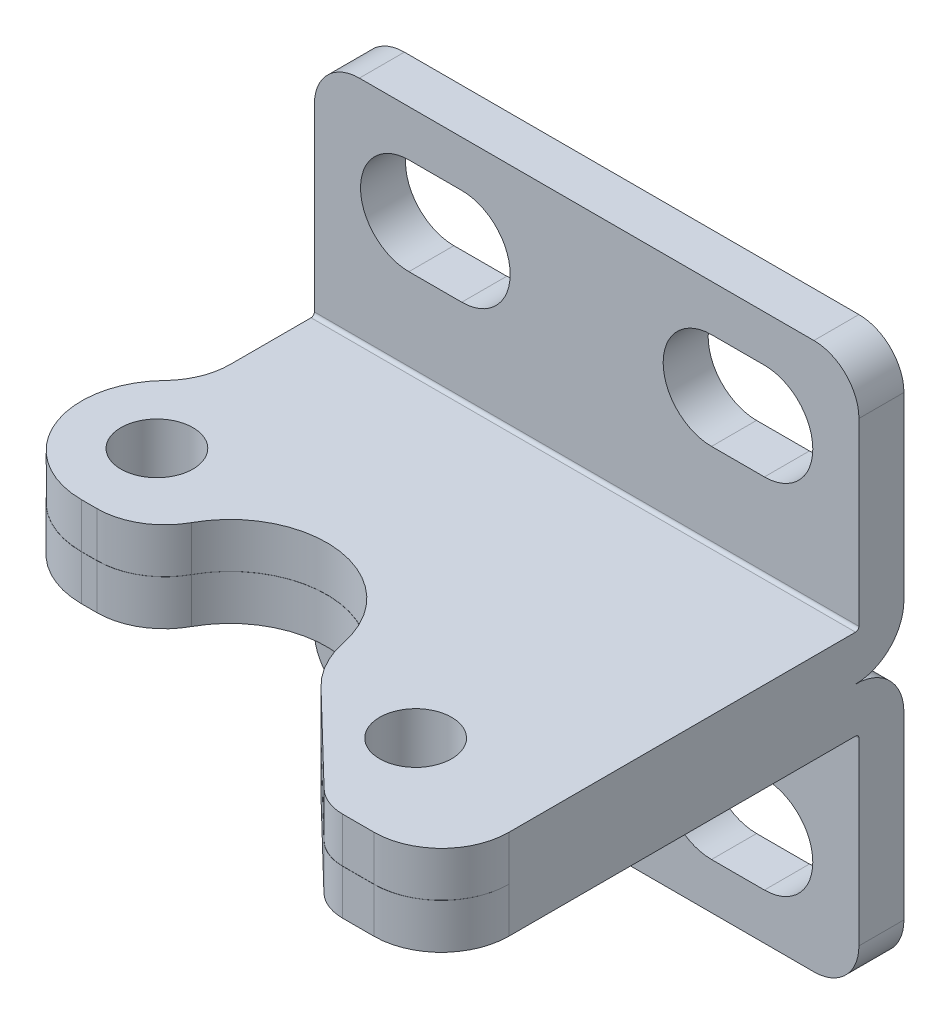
ISO-10303-21;
HEADER;
FILE_DESCRIPTION(('STEP AP214'),'2;1');
FILE_NAME('part.step','',(''),(''),'','','');
FILE_SCHEMA(('AUTOMOTIVE_DESIGN { 1 0 10303 214 1 1 1 1 }'));
ENDSEC;
DATA;
#1=APPLICATION_CONTEXT('core data for automotive mechanical design processes');
#2=APPLICATION_PROTOCOL_DEFINITION('international standard','automotive_design',2000,#1);
#3=PRODUCT_CONTEXT('',#1,'mechanical');
#4=PRODUCT('Part','Part','',(#3));
#5=PRODUCT_RELATED_PRODUCT_CATEGORY('part','',(#4));
#6=PRODUCT_DEFINITION_FORMATION('','',#4);
#7=PRODUCT_DEFINITION_CONTEXT('part definition',#1,'design');
#8=PRODUCT_DEFINITION('design','',#6,#7);
#9=PRODUCT_DEFINITION_SHAPE('','',#8);
#10=(LENGTH_UNIT() NAMED_UNIT(*) SI_UNIT(.MILLI.,.METRE.));
#11=(NAMED_UNIT(*) PLANE_ANGLE_UNIT() SI_UNIT($,.RADIAN.));
#12=(NAMED_UNIT(*) SI_UNIT($,.STERADIAN.) SOLID_ANGLE_UNIT());
#13=UNCERTAINTY_MEASURE_WITH_UNIT(LENGTH_MEASURE(1.E-05),#10,'distance_accuracy_value','');
#14=(GEOMETRIC_REPRESENTATION_CONTEXT(3) GLOBAL_UNCERTAINTY_ASSIGNED_CONTEXT((#13)) GLOBAL_UNIT_ASSIGNED_CONTEXT((#10,
#11,#12)) REPRESENTATION_CONTEXT('',''));
#15=CARTESIAN_POINT('',(0.,0.,0.));
#16=DIRECTION('',(0.,0.,1.));
#17=DIRECTION('',(1.,0.,0.));
#18=AXIS2_PLACEMENT_3D('',#15,#16,#17);
#19=CARTESIAN_POINT('',(17.,7.95,17.5567921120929));
#20=DIRECTION('',(0.,-1.,0.));
#21=DIRECTION('',(1.,0.,0.));
#22=AXIS2_PLACEMENT_3D('',#19,#20,#21);
#23=CYLINDRICAL_SURFACE('',#22,3.);
#24=CARTESIAN_POINT('',(17.,7.95,17.5567921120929));
#25=DIRECTION('',(0.,-1.,0.));
#26=DIRECTION('',(1.,0.,0.));
#27=AXIS2_PLACEMENT_3D('',#24,#25,#26);
#28=CIRCLE('',#27,3.);
#29=CARTESIAN_POINT('',(17.,7.95,20.5567921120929));
#30=VERTEX_POINT('',#29);
#31=CARTESIAN_POINT('',(20.,7.95,17.5567921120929));
#32=VERTEX_POINT('',#31);
#33=EDGE_CURVE('E474',#30,#32,#28,.F.);
#34=ORIENTED_EDGE('',*,*,#33,.F.);
#35=DIRECTION('',(0.,-1.,0.));
#36=VECTOR('',#35,1.);
#37=CARTESIAN_POINT('',(17.,7.95,20.5567921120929));
#38=LINE('',#37,#36);
#39=CARTESIAN_POINT('',(17.,5.95,20.5567921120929));
#40=VERTEX_POINT('',#39);
#41=EDGE_CURVE('E509',#30,#40,#38,.T.);
#42=ORIENTED_EDGE('',*,*,#41,.T.);
#43=CARTESIAN_POINT('',(17.,5.95,17.5567921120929));
#44=DIRECTION('',(0.,-1.,0.));
#45=DIRECTION('',(1.,0.,0.));
#46=AXIS2_PLACEMENT_3D('',#43,#44,#45);
#47=CIRCLE('',#46,3.);
#48=CARTESIAN_POINT('',(20.,5.95,17.5567921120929));
#49=VERTEX_POINT('',#48);
#50=EDGE_CURVE('E512',#40,#49,#47,.F.);
#51=ORIENTED_EDGE('',*,*,#50,.T.);
#52=DIRECTION('',(0.,1.,0.));
#53=VECTOR('',#52,1.);
#54=CARTESIAN_POINT('',(20.,7.95,17.5567921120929));
#55=LINE('',#54,#53);
#56=EDGE_CURVE('E505',#49,#32,#55,.T.);
#57=ORIENTED_EDGE('',*,*,#56,.T.);
#58=EDGE_LOOP('',(#34,#42,#51,#57));
#59=FACE_BOUND('',#58,.T.);
#60=ADVANCED_FACE('F14',(#59),#23,.T.);
#61=CARTESIAN_POINT('',(17.,7.95,20.5567921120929));
#62=DIRECTION('',(0.,0.,-1.));
#63=DIRECTION('',(0.,-1.,0.));
#64=AXIS2_PLACEMENT_3D('',#61,#62,#63);
#65=PLANE('',#64);
#66=DIRECTION('',(0.,-1.,0.));
#67=VECTOR('',#66,1.);
#68=CARTESIAN_POINT('',(15.6080524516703,7.95,20.5567921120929));
#69=LINE('',#68,#67);
#70=CARTESIAN_POINT('',(15.6080524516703,5.95,20.5567921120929));
#71=VERTEX_POINT('',#70);
#72=CARTESIAN_POINT('',(15.6080524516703,7.95,20.5567921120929));
#73=VERTEX_POINT('',#72);
#74=EDGE_CURVE('E546',#71,#73,#69,.F.);
#75=ORIENTED_EDGE('',*,*,#74,.F.);
#76=DIRECTION('',(-1.,0.,0.));
#77=VECTOR('',#76,1.);
#78=CARTESIAN_POINT('',(17.,5.95,20.5567921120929));
#79=LINE('',#78,#77);
#80=EDGE_CURVE('E518',#71,#40,#79,.F.);
#81=ORIENTED_EDGE('',*,*,#80,.T.);
#82=ORIENTED_EDGE('',*,*,#41,.F.);
#83=DIRECTION('',(-1.,0.,0.));
#84=VECTOR('',#83,1.);
#85=CARTESIAN_POINT('',(17.,7.95,20.5567921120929));
#86=LINE('',#85,#84);
#87=EDGE_CURVE('E544',#73,#30,#86,.F.);
#88=ORIENTED_EDGE('',*,*,#87,.F.);
#89=EDGE_LOOP('',(#75,#81,#82,#88));
#90=FACE_BOUND('',#89,.T.);
#91=ADVANCED_FACE('F912',(#90),#65,.F.);
#92=CARTESIAN_POINT('',(15.6080524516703,7.95,18.5567921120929));
#93=DIRECTION('',(0.,-1.,0.));
#94=DIRECTION('',(1.,0.,0.));
#95=AXIS2_PLACEMENT_3D('',#92,#93,#94);
#96=CYLINDRICAL_SURFACE('',#95,2.);
#97=CARTESIAN_POINT('',(15.6080524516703,5.95,18.5567921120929));
#98=DIRECTION('',(0.,-1.,0.));
#99=DIRECTION('',(1.,0.,0.));
#100=AXIS2_PLACEMENT_3D('',#97,#98,#99);
#101=CIRCLE('',#100,2.);
#102=CARTESIAN_POINT('',(14.2187357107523,5.95,19.9954717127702));
#103=VERTEX_POINT('',#102);
#104=EDGE_CURVE('E521',#103,#71,#101,.F.);
#105=ORIENTED_EDGE('',*,*,#104,.T.);
#106=ORIENTED_EDGE('',*,*,#74,.T.);
#107=CARTESIAN_POINT('',(15.6080524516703,7.95,18.5567921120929));
#108=DIRECTION('',(0.,-1.,0.));
#109=DIRECTION('',(1.,0.,0.));
#110=AXIS2_PLACEMENT_3D('',#107,#108,#109);
#111=CIRCLE('',#110,2.);
#112=CARTESIAN_POINT('',(14.2187357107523,7.95,19.9954717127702));
#113=VERTEX_POINT('',#112);
#114=EDGE_CURVE('E549',#73,#113,#111,.T.);
#115=ORIENTED_EDGE('',*,*,#114,.T.);
#116=DIRECTION('',(0.,1.,0.));
#117=VECTOR('',#116,1.);
#118=CARTESIAN_POINT('',(14.2187357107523,7.95,19.9954717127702));
#119=LINE('',#118,#117);
#120=EDGE_CURVE('E513',#113,#103,#119,.F.);
#121=ORIENTED_EDGE('',*,*,#120,.T.);
#122=EDGE_LOOP('',(#105,#106,#115,#121));
#123=FACE_BOUND('',#122,.T.);
#124=ADVANCED_FACE('F909',(#123),#96,.T.);
#125=CARTESIAN_POINT('',(14.2187357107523,7.95,19.9954717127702));
#126=DIRECTION('',(0.694658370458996,0.,-0.719339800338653));
#127=DIRECTION('',(-0.719339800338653,0.,-0.694658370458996));
#128=AXIS2_PLACEMENT_3D('',#125,#126,#127);
#129=PLANE('',#128);
#130=ORIENTED_EDGE('',*,*,#120,.F.);
#131=DIRECTION('',(0.719339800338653,0.,0.694658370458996));
#132=VECTOR('',#131,1.);
#133=CARTESIAN_POINT('',(10.2448835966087,7.95,16.1579673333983));
#134=LINE('',#133,#132);
#135=CARTESIAN_POINT('',(10.2448835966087,7.95,16.1579673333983));
#136=VERTEX_POINT('',#135);
#137=EDGE_CURVE('E475',#136,#113,#134,.T.);
#138=ORIENTED_EDGE('',*,*,#137,.F.);
#139=DIRECTION('',(0.,-1.,0.));
#140=VECTOR('',#139,1.);
#141=CARTESIAN_POINT('',(10.2448835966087,7.95,16.1579673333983));
#142=LINE('',#141,#140);
#143=CARTESIAN_POINT('',(10.2448835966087,5.95,16.1579673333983));
#144=VERTEX_POINT('',#143);
#145=EDGE_CURVE('E479',#144,#136,#142,.F.);
#146=ORIENTED_EDGE('',*,*,#145,.F.);
#147=DIRECTION('',(-0.719339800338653,0.,-0.694658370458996));
#148=VECTOR('',#147,1.);
#149=CARTESIAN_POINT('',(14.2187357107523,5.95,19.9954717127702));
#150=LINE('',#149,#148);
#151=EDGE_CURVE('E515',#103,#144,#150,.T.);
#152=ORIENTED_EDGE('',*,*,#151,.F.);
#153=EDGE_LOOP('',(#130,#138,#146,#152));
#154=FACE_BOUND('',#153,.T.);
#155=ADVANCED_FACE('F904',(#154),#129,.F.);
#156=CARTESIAN_POINT('',(13.2319145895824,7.95,13.0648061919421));
#157=DIRECTION('',(0.,-1.,0.));
#158=DIRECTION('',(1.,0.,0.));
#159=AXIS2_PLACEMENT_3D('',#156,#157,#158);
#160=CYLINDRICAL_SURFACE('',#159,4.3);
#161=CARTESIAN_POINT('',(13.2319145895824,7.95,13.0648061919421));
#162=DIRECTION('',(0.,-1.,0.));
#163=DIRECTION('',(1.,0.,0.));
#164=AXIS2_PLACEMENT_3D('',#161,#162,#163);
#165=CIRCLE('',#164,4.3);
#166=CARTESIAN_POINT('',(9.0159572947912,7.95,13.9107991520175));
#167=VERTEX_POINT('',#166);
#168=EDGE_CURVE('E558',#167,#136,#165,.F.);
#169=ORIENTED_EDGE('',*,*,#168,.F.);
#170=DIRECTION('',(0.,-1.,0.));
#171=VECTOR('',#170,1.);
#172=CARTESIAN_POINT('',(9.01595729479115,7.95,13.9107991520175));
#173=LINE('',#172,#171);
#174=CARTESIAN_POINT('',(9.0159572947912,5.95,13.9107991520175));
#175=VERTEX_POINT('',#174);
#176=EDGE_CURVE('E478',#167,#175,#173,.T.);
#177=ORIENTED_EDGE('',*,*,#176,.T.);
#178=CARTESIAN_POINT('',(13.2319145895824,5.95,13.0648061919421));
#179=DIRECTION('',(0.,-1.,0.));
#180=DIRECTION('',(1.,0.,0.));
#181=AXIS2_PLACEMENT_3D('',#178,#179,#180);
#182=CIRCLE('',#181,4.3);
#183=EDGE_CURVE('E482',#175,#144,#182,.F.);
#184=ORIENTED_EDGE('',*,*,#183,.T.);
#185=ORIENTED_EDGE('',*,*,#145,.T.);
#186=EDGE_LOOP('',(#169,#177,#184,#185));
#187=FACE_BOUND('',#186,.T.);
#188=ADVANCED_FACE('F899',(#187),#160,.T.);
#189=CARTESIAN_POINT('',(4.8,7.95,14.7567921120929));
#190=DIRECTION('',(0.,-1.,0.));
#191=DIRECTION('',(1.,0.,0.));
#192=AXIS2_PLACEMENT_3D('',#189,#190,#191);
#193=CYLINDRICAL_SURFACE('',#192,4.3);
#194=ORIENTED_EDGE('',*,*,#176,.F.);
#195=CARTESIAN_POINT('',(4.8,7.95,14.7567921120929));
#196=DIRECTION('',(0.,-1.,0.));
#197=DIRECTION('',(1.,0.,0.));
#198=AXIS2_PLACEMENT_3D('',#195,#196,#197);
#199=CIRCLE('',#198,4.3);
#200=CARTESIAN_POINT('',(1.02645727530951,7.95,12.6951482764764));
#201=VERTEX_POINT('',#200);
#202=EDGE_CURVE('E562',#201,#167,#199,.T.);
#203=ORIENTED_EDGE('',*,*,#202,.F.);
#204=DIRECTION('',(0.,-1.,0.));
#205=VECTOR('',#204,1.);
#206=CARTESIAN_POINT('',(1.02645727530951,7.95,12.6951482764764));
#207=LINE('',#206,#205);
#208=CARTESIAN_POINT('',(1.02645727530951,5.95,12.6951482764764));
#209=VERTEX_POINT('',#208);
#210=EDGE_CURVE('E485',#209,#201,#207,.F.);
#211=ORIENTED_EDGE('',*,*,#210,.F.);
#212=CARTESIAN_POINT('',(4.8,5.95,14.7567921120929));
#213=DIRECTION('',(0.,-1.,0.));
#214=DIRECTION('',(1.,0.,0.));
#215=AXIS2_PLACEMENT_3D('',#212,#213,#214);
#216=CIRCLE('',#215,4.3);
#217=EDGE_CURVE('E487',#175,#209,#216,.F.);
#218=ORIENTED_EDGE('',*,*,#217,.F.);
#219=EDGE_LOOP('',(#194,#203,#211,#218));
#220=FACE_BOUND('',#219,.T.);
#221=ADVANCED_FACE('F896',(#220),#193,.F.);
#222=CARTESIAN_POINT('',(-1.6062469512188,7.95,11.2567921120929));
#223=DIRECTION('',(0.,-1.,0.));
#224=DIRECTION('',(1.,0.,0.));
#225=AXIS2_PLACEMENT_3D('',#222,#223,#224);
#226=CYLINDRICAL_SURFACE('',#225,3.);
#227=CARTESIAN_POINT('',(-1.6062469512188,7.95,11.2567921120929));
#228=DIRECTION('',(0.,-1.,0.));
#229=DIRECTION('',(1.,0.,0.));
#230=AXIS2_PLACEMENT_3D('',#227,#228,#229);
#231=CIRCLE('',#230,3.);
#232=CARTESIAN_POINT('',(-1.6062469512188,7.95,14.2567921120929));
#233=VERTEX_POINT('',#232);
#234=EDGE_CURVE('E565',#233,#201,#231,.F.);
#235=ORIENTED_EDGE('',*,*,#234,.F.);
#236=DIRECTION('',(0.,-1.,0.));
#237=VECTOR('',#236,1.);
#238=CARTESIAN_POINT('',(-1.6062469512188,7.95,14.2567921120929));
#239=LINE('',#238,#237);
#240=CARTESIAN_POINT('',(-1.6062469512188,5.95,14.2567921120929));
#241=VERTEX_POINT('',#240);
#242=EDGE_CURVE('E488',#233,#241,#239,.T.);
#243=ORIENTED_EDGE('',*,*,#242,.T.);
#244=CARTESIAN_POINT('',(-1.6062469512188,5.95,11.2567921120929));
#245=DIRECTION('',(0.,-1.,0.));
#246=DIRECTION('',(1.,0.,0.));
#247=AXIS2_PLACEMENT_3D('',#244,#245,#246);
#248=CIRCLE('',#247,3.);
#249=EDGE_CURVE('E491',#241,#209,#248,.F.);
#250=ORIENTED_EDGE('',*,*,#249,.T.);
#251=ORIENTED_EDGE('',*,*,#210,.T.);
#252=EDGE_LOOP('',(#235,#243,#250,#251));
#253=FACE_BOUND('',#252,.T.);
#254=ADVANCED_FACE('F891',(#253),#226,.T.);
#255=CARTESIAN_POINT('',(-2.3,7.95,14.2567921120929));
#256=DIRECTION('',(0.,0.,-1.));
#257=DIRECTION('',(-1.,0.,0.));
#258=AXIS2_PLACEMENT_3D('',#255,#256,#257);
#259=PLANE('',#258);
#260=ORIENTED_EDGE('',*,*,#242,.F.);
#261=DIRECTION('',(-1.,0.,0.));
#262=VECTOR('',#261,1.);
#263=CARTESIAN_POINT('',(-2.3,7.95,14.2567921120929));
#264=LINE('',#263,#262);
#265=CARTESIAN_POINT('',(-2.3,7.95,14.2567921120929));
#266=VERTEX_POINT('',#265);
#267=EDGE_CURVE('E525',#266,#233,#264,.F.);
#268=ORIENTED_EDGE('',*,*,#267,.F.);
#269=DIRECTION('',(0.,-1.,0.));
#270=VECTOR('',#269,1.);
#271=CARTESIAN_POINT('',(-2.3,7.95,14.2567921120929));
#272=LINE('',#271,#270);
#273=CARTESIAN_POINT('',(-2.3,5.95,14.2567921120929));
#274=VERTEX_POINT('',#273);
#275=EDGE_CURVE('E492',#274,#266,#272,.F.);
#276=ORIENTED_EDGE('',*,*,#275,.F.);
#277=DIRECTION('',(-1.,0.,0.));
#278=VECTOR('',#277,1.);
#279=CARTESIAN_POINT('',(17.,5.95,14.2567921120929));
#280=LINE('',#279,#278);
#281=EDGE_CURVE('E522',#274,#241,#280,.F.);
#282=ORIENTED_EDGE('',*,*,#281,.T.);
#283=EDGE_LOOP('',(#260,#268,#276,#282));
#284=FACE_BOUND('',#283,.T.);
#285=ADVANCED_FACE('F887',(#284),#259,.F.);
#286=CARTESIAN_POINT('',(-2.3,7.95,10.4567921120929));
#287=DIRECTION('',(0.,-1.,0.));
#288=DIRECTION('',(1.,0.,0.));
#289=AXIS2_PLACEMENT_3D('',#286,#287,#288);
#290=CYLINDRICAL_SURFACE('',#289,3.8);
#291=CARTESIAN_POINT('',(-2.3,7.95,10.4567921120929));
#292=DIRECTION('',(0.,-1.,0.));
#293=DIRECTION('',(1.,0.,0.));
#294=AXIS2_PLACEMENT_3D('',#291,#292,#293);
#295=CIRCLE('',#294,3.8);
#296=CARTESIAN_POINT('',(-5.03823529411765,7.95,7.82201176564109));
#297=VERTEX_POINT('',#296);
#298=CARTESIAN_POINT('',(-6.09999848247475,7.95,10.453396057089));
#299=VERTEX_POINT('',#298);
#300=EDGE_CURVE('E568',#297,#299,#295,.F.);
#301=ORIENTED_EDGE('',*,*,#300,.F.);
#302=DIRECTION('',(0.,-1.,0.));
#303=VECTOR('',#302,1.);
#304=CARTESIAN_POINT('',(-5.03823529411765,7.95,7.82201176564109));
#305=LINE('',#304,#303);
#306=CARTESIAN_POINT('',(-5.03823529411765,5.95,7.8220117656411));
#307=VERTEX_POINT('',#306);
#308=EDGE_CURVE('E495',#297,#307,#305,.T.);
#309=ORIENTED_EDGE('',*,*,#308,.T.);
#310=CARTESIAN_POINT('',(-2.3,5.95,10.4567921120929));
#311=DIRECTION('',(0.,-1.,0.));
#312=DIRECTION('',(1.,0.,0.));
#313=AXIS2_PLACEMENT_3D('',#310,#311,#312);
#314=CIRCLE('',#313,3.8);
#315=EDGE_CURVE('E496',#307,#274,#314,.F.);
#316=ORIENTED_EDGE('',*,*,#315,.T.);
#317=ORIENTED_EDGE('',*,*,#275,.T.);
#318=EDGE_CURVE('E571',#299,#266,#295,.F.);
#319=ORIENTED_EDGE('',*,*,#318,.F.);
#320=EDGE_LOOP('',(#301,#309,#316,#317,#319));
#321=FACE_BOUND('',#320,.T.);
#322=ADVANCED_FACE('F880',(#321),#290,.T.);
#323=CARTESIAN_POINT('',(17.,7.95,17.5567921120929));
#324=DIRECTION('',(0.,1.,0.));
#325=DIRECTION('',(-1.,0.,0.));
#326=AXIS2_PLACEMENT_3D('',#323,#324,#325);
#327=PLANE('',#326);
#328=CARTESIAN_POINT('',(17.,7.95,17.5500000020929));
#329=DIRECTION('',(0.,1.,0.));
#330=DIRECTION('',(-1.,0.,0.));
#331=AXIS2_PLACEMENT_3D('',#328,#329,#330);
#332=CIRCLE('',#331,3.);
#333=CARTESIAN_POINT('',(17.,7.95,20.5500000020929));
#334=VERTEX_POINT('',#333);
#335=EDGE_CURVE('E619',#334,#32,#332,.T.);
#336=ORIENTED_EDGE('',*,*,#335,.F.);
#337=DIRECTION('',(-1.,0.,0.));
#338=VECTOR('',#337,1.);
#339=CARTESIAN_POINT('',(17.,7.95,20.5500000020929));
#340=LINE('',#339,#338);
#341=CARTESIAN_POINT('',(15.6080524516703,7.95,20.5500000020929));
#342=VERTEX_POINT('',#341);
#343=EDGE_CURVE('E613',#334,#342,#340,.T.);
#344=ORIENTED_EDGE('',*,*,#343,.T.);
#345=CARTESIAN_POINT('',(15.6080524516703,7.95,18.5500000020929));
#346=DIRECTION('',(0.,1.,0.));
#347=DIRECTION('',(-1.,0.,0.));
#348=AXIS2_PLACEMENT_3D('',#345,#346,#347);
#349=CIRCLE('',#348,2.);
#350=CARTESIAN_POINT('',(14.2187357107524,7.95,19.9886796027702));
#351=VERTEX_POINT('',#350);
#352=EDGE_CURVE('E609',#351,#342,#349,.T.);
#353=ORIENTED_EDGE('',*,*,#352,.F.);
#354=DIRECTION('',(-0.719339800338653,0.,-0.694658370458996));
#355=VECTOR('',#354,1.);
#356=CARTESIAN_POINT('',(14.4426971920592,7.95,20.2049566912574));
#357=LINE('',#356,#355);
#358=CARTESIAN_POINT('',(10.2448835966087,7.95,16.1511752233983));
#359=VERTEX_POINT('',#358);
#360=EDGE_CURVE('E561',#351,#359,#357,.T.);
#361=ORIENTED_EDGE('',*,*,#360,.T.);
#362=CARTESIAN_POINT('',(13.2319145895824,7.95,13.0580140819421));
#363=DIRECTION('',(0.,1.,0.));
#364=DIRECTION('',(-1.,0.,0.));
#365=AXIS2_PLACEMENT_3D('',#362,#363,#364);
#366=CIRCLE('',#365,4.3);
#367=CARTESIAN_POINT('',(9.0159572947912,7.95,13.9040070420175));
#368=VERTEX_POINT('',#367);
#369=EDGE_CURVE('E601',#368,#359,#366,.T.);
#370=ORIENTED_EDGE('',*,*,#369,.F.);
#371=CARTESIAN_POINT('',(4.8,7.95,14.7500000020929));
#372=DIRECTION('',(0.,1.,0.));
#373=DIRECTION('',(-1.,0.,0.));
#374=AXIS2_PLACEMENT_3D('',#371,#372,#373);
#375=CIRCLE('',#374,4.3);
#376=CARTESIAN_POINT('',(1.02645727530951,7.95,12.6883561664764));
#377=VERTEX_POINT('',#376);
#378=EDGE_CURVE('E604',#368,#377,#375,.T.);
#379=ORIENTED_EDGE('',*,*,#378,.T.);
#380=CARTESIAN_POINT('',(-1.60624695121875,7.95,11.2500000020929));
#381=DIRECTION('',(0.,1.,0.));
#382=DIRECTION('',(-1.,0.,0.));
#383=AXIS2_PLACEMENT_3D('',#380,#381,#382);
#384=CIRCLE('',#383,3.);
#385=CARTESIAN_POINT('',(-1.60624695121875,7.95,14.2500000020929));
#386=VERTEX_POINT('',#385);
#387=EDGE_CURVE('E606',#386,#377,#384,.T.);
#388=ORIENTED_EDGE('',*,*,#387,.F.);
#389=DIRECTION('',(-1.,0.,0.));
#390=VECTOR('',#389,1.);
#391=CARTESIAN_POINT('',(17.,7.95,14.2500000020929));
#392=LINE('',#391,#390);
#393=CARTESIAN_POINT('',(-2.3,7.95,14.2500000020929));
#394=VERTEX_POINT('',#393);
#395=EDGE_CURVE('E611',#386,#394,#392,.T.);
#396=ORIENTED_EDGE('',*,*,#395,.T.);
#397=CARTESIAN_POINT('',(-2.3,7.95,10.4500000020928));
#398=DIRECTION('',(0.,1.,0.));
#399=DIRECTION('',(-1.,0.,0.));
#400=AXIS2_PLACEMENT_3D('',#397,#398,#399);
#401=CIRCLE('',#400,3.8);
#402=EDGE_CURVE('E616',#299,#394,#401,.T.);
#403=ORIENTED_EDGE('',*,*,#402,.F.);
#404=ORIENTED_EDGE('',*,*,#318,.T.);
#405=ORIENTED_EDGE('',*,*,#267,.T.);
#406=ORIENTED_EDGE('',*,*,#234,.T.);
#407=ORIENTED_EDGE('',*,*,#202,.T.);
#408=ORIENTED_EDGE('',*,*,#168,.T.);
#409=ORIENTED_EDGE('',*,*,#137,.T.);
#410=ORIENTED_EDGE('',*,*,#114,.F.);
#411=ORIENTED_EDGE('',*,*,#87,.T.);
#412=ORIENTED_EDGE('',*,*,#33,.T.);
#413=EDGE_LOOP('',(#336,#344,#353,#361,#370,#379,#388,#396,#403,#404,#405,#406,#407,#408,#409,
#410,#411,#412));
#414=FACE_BOUND('',#413,.T.);
#415=ADVANCED_FACE('F884',(#414),#327,.T.);
#416=CARTESIAN_POINT('',(20.,7.95,-9.65320788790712));
#417=DIRECTION('',(-1.,0.,0.));
#418=DIRECTION('',(0.,0.,1.));
#419=AXIS2_PLACEMENT_3D('',#416,#417,#418);
#420=PLANE('',#419);
#421=DIRECTION('',(0.,-1.,0.));
#422=VECTOR('',#421,1.);
#423=CARTESIAN_POINT('',(20.,-4.19679211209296,2.00000000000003));
#424=LINE('',#423,#422);
#425=CARTESIAN_POINT('',(20.,-2.20000000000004,2.));
#426=VERTEX_POINT('',#425);
#427=CARTESIAN_POINT('',(20.,5.8,1.99999999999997));
#428=VERTEX_POINT('',#427);
#429=EDGE_CURVE('E555',#426,#428,#424,.F.);
#430=ORIENTED_EDGE('',*,*,#429,.F.);
#431=DIRECTION('',(0.,0.,-1.));
#432=VECTOR('',#431,1.);
#433=CARTESIAN_POINT('',(20.,-2.20000000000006,0.));
#434=LINE('',#433,#432);
#435=CARTESIAN_POINT('',(20.,-2.20000000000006,0.));
#436=VERTEX_POINT('',#435);
#437=EDGE_CURVE('E731',#426,#436,#434,.T.);
#438=ORIENTED_EDGE('',*,*,#437,.T.);
#439=DIRECTION('',(0.,-1.,0.));
#440=VECTOR('',#439,1.);
#441=CARTESIAN_POINT('',(20.,23.0132078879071,-1.60136660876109E-13));
#442=LINE('',#441,#440);
#443=CARTESIAN_POINT('',(20.,5.8,0.));
#444=VERTEX_POINT('',#443);
#445=EDGE_CURVE('E538',#444,#436,#442,.T.);
#446=ORIENTED_EDGE('',*,*,#445,.F.);
#447=CARTESIAN_POINT('',(20.,5.8,2.14999999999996));
#448=DIRECTION('',(-1.,0.,0.));
#449=DIRECTION('',(0.,-1.,0.));
#450=AXIS2_PLACEMENT_3D('',#447,#448,#449);
#451=CIRCLE('',#450,2.15);
#452=CARTESIAN_POINT('',(20.,7.95,2.14999999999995));
#453=VERTEX_POINT('',#452);
#454=EDGE_CURVE('E535',#453,#444,#451,.T.);
#455=ORIENTED_EDGE('',*,*,#454,.F.);
#456=CARTESIAN_POINT('',(20.,10.1,2.14999999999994));
#457=DIRECTION('',(-1.,0.,0.));
#458=DIRECTION('',(0.,-1.,0.));
#459=AXIS2_PLACEMENT_3D('',#456,#457,#458);
#460=CIRCLE('',#459,2.15);
#461=CARTESIAN_POINT('',(20.,10.1,0.));
#462=VERTEX_POINT('',#461);
#463=EDGE_CURVE('E672',#462,#453,#460,.T.);
#464=ORIENTED_EDGE('',*,*,#463,.F.);
#465=DIRECTION('',(0.,1.,0.));
#466=VECTOR('',#465,1.);
#467=CARTESIAN_POINT('',(20.,-7.10641577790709,0.));
#468=LINE('',#467,#466);
#469=CARTESIAN_POINT('',(20.,18.100000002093,0.));
#470=VERTEX_POINT('',#469);
#471=EDGE_CURVE('E682',#462,#470,#468,.T.);
#472=ORIENTED_EDGE('',*,*,#471,.T.);
#473=DIRECTION('',(0.,0.,-1.));
#474=VECTOR('',#473,1.);
#475=CARTESIAN_POINT('',(20.,18.100000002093,-9.65320788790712));
#476=LINE('',#475,#474);
#477=CARTESIAN_POINT('',(20.,18.100000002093,1.99999999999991));
#478=VERTEX_POINT('',#477);
#479=EDGE_CURVE('E622',#470,#478,#476,.F.);
#480=ORIENTED_EDGE('',*,*,#479,.T.);
#481=DIRECTION('',(0.,-1.,0.));
#482=VECTOR('',#481,1.);
#483=CARTESIAN_POINT('',(20.,20.100000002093,1.9999999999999));
#484=LINE('',#483,#482);
#485=CARTESIAN_POINT('',(20.,10.1,1.99999999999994));
#486=VERTEX_POINT('',#485);
#487=EDGE_CURVE('E696',#486,#478,#484,.F.);
#488=ORIENTED_EDGE('',*,*,#487,.F.);
#489=CARTESIAN_POINT('',(20.,10.1,2.14999999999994));
#490=DIRECTION('',(-1.,0.,0.));
#491=DIRECTION('',(0.,-1.,0.));
#492=AXIS2_PLACEMENT_3D('',#489,#490,#491);
#493=CIRCLE('',#492,0.15);
#494=CARTESIAN_POINT('',(20.,9.95,2.14999999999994));
#495=VERTEX_POINT('',#494);
#496=EDGE_CURVE('E681',#495,#486,#493,.F.);
#497=ORIENTED_EDGE('',*,*,#496,.F.);
#498=DIRECTION('',(0.,0.,1.));
#499=VECTOR('',#498,1.);
#500=CARTESIAN_POINT('',(20.,9.95,-9.65641577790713));
#501=LINE('',#500,#499);
#502=CARTESIAN_POINT('',(20.,9.95,17.5500000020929));
#503=VERTEX_POINT('',#502);
#504=EDGE_CURVE('E657',#503,#495,#501,.F.);
#505=ORIENTED_EDGE('',*,*,#504,.F.);
#506=DIRECTION('',(0.,1.,0.));
#507=VECTOR('',#506,1.);
#508=CARTESIAN_POINT('',(20.,9.95,17.5500000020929));
#509=LINE('',#508,#507);
#510=CARTESIAN_POINT('',(20.,7.95,17.5500000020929));
#511=VERTEX_POINT('',#510);
#512=EDGE_CURVE('E654',#511,#503,#509,.T.);
#513=ORIENTED_EDGE('',*,*,#512,.F.);
#514=DIRECTION('',(0.,0.,1.));
#515=VECTOR('',#514,1.);
#516=CARTESIAN_POINT('',(20.,7.95,17.5567921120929));
#517=LINE('',#516,#515);
#518=EDGE_CURVE('E472',#32,#511,#517,.F.);
#519=ORIENTED_EDGE('',*,*,#518,.F.);
#520=ORIENTED_EDGE('',*,*,#56,.F.);
#521=DIRECTION('',(0.,0.,1.));
#522=VECTOR('',#521,1.);
#523=CARTESIAN_POINT('',(20.,5.95,-9.65320788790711));
#524=LINE('',#523,#522);
#525=CARTESIAN_POINT('',(20.,5.95,2.14999999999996));
#526=VERTEX_POINT('',#525);
#527=EDGE_CURVE('E508',#526,#49,#524,.T.);
#528=ORIENTED_EDGE('',*,*,#527,.F.);
#529=CARTESIAN_POINT('',(20.,5.8,2.14999999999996));
#530=DIRECTION('',(-1.,0.,0.));
#531=DIRECTION('',(0.,-1.,0.));
#532=AXIS2_PLACEMENT_3D('',#529,#530,#531);
#533=CIRCLE('',#532,0.15);
#534=EDGE_CURVE('E541',#526,#428,#533,.T.);
#535=ORIENTED_EDGE('',*,*,#534,.T.);
#536=EDGE_LOOP('',(#430,#438,#446,#455,#464,#472,#480,#488,#497,#505,#513,#519,#520,#528,#535));
#537=FACE_BOUND('',#536,.T.);
#538=ADVANCED_FACE('F849',(#537),#420,.F.);
#539=CARTESIAN_POINT('',(-7.2,7.95,5.74192201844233));
#540=DIRECTION('',(0.,-1.,0.));
#541=DIRECTION('',(1.,0.,0.));
#542=AXIS2_PLACEMENT_3D('',#539,#540,#541);
#543=CYLINDRICAL_SURFACE('',#542,3.);
#544=ORIENTED_EDGE('',*,*,#308,.F.);
#545=CARTESIAN_POINT('',(-7.2,7.95,5.74192201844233));
#546=DIRECTION('',(0.,-1.,0.));
#547=DIRECTION('',(1.,0.,0.));
#548=AXIS2_PLACEMENT_3D('',#545,#546,#547);
#549=CIRCLE('',#548,3.);
#550=CARTESIAN_POINT('',(-4.2,7.95,5.74192201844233));
#551=VERTEX_POINT('',#550);
#552=EDGE_CURVE('E470',#551,#297,#549,.T.);
#553=ORIENTED_EDGE('',*,*,#552,.F.);
#554=DIRECTION('',(0.,-1.,0.));
#555=VECTOR('',#554,1.);
#556=CARTESIAN_POINT('',(-4.2,7.95,5.74192201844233));
#557=LINE('',#556,#555);
#558=CARTESIAN_POINT('',(-4.2,5.95,5.74192201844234));
#559=VERTEX_POINT('',#558);
#560=EDGE_CURVE('E499',#559,#551,#557,.F.);
#561=ORIENTED_EDGE('',*,*,#560,.F.);
#562=CARTESIAN_POINT('',(-7.2,5.95,5.74192201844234));
#563=DIRECTION('',(0.,-1.,0.));
#564=DIRECTION('',(1.,0.,0.));
#565=AXIS2_PLACEMENT_3D('',#562,#563,#564);
#566=CIRCLE('',#565,3.);
#567=EDGE_CURVE('E502',#307,#559,#566,.F.);
#568=ORIENTED_EDGE('',*,*,#567,.F.);
#569=EDGE_LOOP('',(#544,#553,#561,#568));
#570=FACE_BOUND('',#569,.T.);
#571=ADVANCED_FACE('F866',(#570),#543,.F.);
#572=CARTESIAN_POINT('',(17.,5.95,17.5567921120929));
#573=DIRECTION('',(0.,1.,0.));
#574=DIRECTION('',(-1.,0.,0.));
#575=AXIS2_PLACEMENT_3D('',#572,#573,#574);
#576=PLANE('',#575);
#577=ORIENTED_EDGE('',*,*,#104,.F.);
#578=ORIENTED_EDGE('',*,*,#151,.T.);
#579=ORIENTED_EDGE('',*,*,#183,.F.);
#580=ORIENTED_EDGE('',*,*,#217,.T.);
#581=ORIENTED_EDGE('',*,*,#249,.F.);
#582=ORIENTED_EDGE('',*,*,#281,.F.);
#583=ORIENTED_EDGE('',*,*,#315,.F.);
#584=ORIENTED_EDGE('',*,*,#567,.T.);
#585=DIRECTION('',(0.,0.,-1.));
#586=VECTOR('',#585,1.);
#587=CARTESIAN_POINT('',(-4.2,5.95,5.74192201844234));
#588=LINE('',#587,#586);
#589=CARTESIAN_POINT('',(-4.2,5.95,2.14999999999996));
#590=VERTEX_POINT('',#589);
#591=EDGE_CURVE('E503',#559,#590,#588,.T.);
#592=ORIENTED_EDGE('',*,*,#591,.T.);
#593=DIRECTION('',(-1.,0.,0.));
#594=VECTOR('',#593,1.);
#595=CARTESIAN_POINT('',(17.,5.95,2.14999999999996));
#596=LINE('',#595,#594);
#597=EDGE_CURVE('E524',#526,#590,#596,.T.);
#598=ORIENTED_EDGE('',*,*,#597,.F.);
#599=ORIENTED_EDGE('',*,*,#527,.T.);
#600=ORIENTED_EDGE('',*,*,#50,.F.);
#601=ORIENTED_EDGE('',*,*,#80,.F.);
#602=EDGE_LOOP('',(#577,#578,#579,#580,#581,#582,#583,#584,#592,#598,#599,#600,#601));
#603=FACE_BOUND('',#602,.T.);
#604=CARTESIAN_POINT('',(-2.59999999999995,5.95,10.6));
#605=DIRECTION('',(0.,1.,0.));
#606=DIRECTION('',(-1.,0.,0.));
#607=AXIS2_PLACEMENT_3D('',#604,#605,#606);
#608=CIRCLE('',#607,1.6);
#609=CARTESIAN_POINT('',(-4.19999999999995,5.95,10.6));
#610=VERTEX_POINT('',#609);
#611=EDGE_CURVE('E516',#610,#610,#608,.T.);
#612=ORIENTED_EDGE('',*,*,#611,.T.);
#613=EDGE_LOOP('',(#612));
#614=FACE_BOUND('',#613,.T.);
#615=CARTESIAN_POINT('',(14.3,5.95,16.));
#616=DIRECTION('',(0.,1.,0.));
#617=DIRECTION('',(-1.,0.,0.));
#618=AXIS2_PLACEMENT_3D('',#615,#616,#617);
#619=CIRCLE('',#618,1.6);
#620=CARTESIAN_POINT('',(12.7,5.95,16.));
#621=VERTEX_POINT('',#620);
#622=EDGE_CURVE('E520',#621,#621,#619,.T.);
#623=ORIENTED_EDGE('',*,*,#622,.T.);
#624=EDGE_LOOP('',(#623));
#625=FACE_BOUND('',#624,.T.);
#626=ADVANCED_FACE('F858',(#603,#614,#625),#576,.F.);
#627=CARTESIAN_POINT('',(32.2496024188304,5.8,2.14999999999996));
#628=DIRECTION('',(-1.,0.,0.));
#629=DIRECTION('',(0.,-1.,0.));
#630=AXIS2_PLACEMENT_3D('',#627,#628,#629);
#631=CYLINDRICAL_SURFACE('',#630,0.15);
#632=CARTESIAN_POINT('',(-4.2,5.8,2.14999999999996));
#633=DIRECTION('',(-1.,0.,0.));
#634=DIRECTION('',(0.,-1.,0.));
#635=AXIS2_PLACEMENT_3D('',#632,#633,#634);
#636=CIRCLE('',#635,0.15);
#637=CARTESIAN_POINT('',(-4.2,5.8,1.99999999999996));
#638=VERTEX_POINT('',#637);
#639=EDGE_CURVE('E527',#638,#590,#636,.F.);
#640=ORIENTED_EDGE('',*,*,#639,.F.);
#641=DIRECTION('',(-1.,0.,0.));
#642=VECTOR('',#641,1.);
#643=CARTESIAN_POINT('',(32.2496024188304,5.8,1.99999999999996));
#644=LINE('',#643,#642);
#645=EDGE_CURVE('E550',#428,#638,#644,.T.);
#646=ORIENTED_EDGE('',*,*,#645,.F.);
#647=ORIENTED_EDGE('',*,*,#534,.F.);
#648=ORIENTED_EDGE('',*,*,#597,.T.);
#649=EDGE_LOOP('',(#640,#646,#647,#648));
#650=FACE_BOUND('',#649,.T.);
#651=ADVANCED_FACE('F855',(#650),#631,.F.);
#652=CARTESIAN_POINT('',(17.,23.0132078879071,1.99999999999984));
#653=DIRECTION('',(0.,0.,-1.));
#654=DIRECTION('',(0.,-1.,0.));
#655=AXIS2_PLACEMENT_3D('',#652,#653,#654);
#656=PLANE('',#655);
#657=DIRECTION('',(1.,0.,0.));
#658=VECTOR('',#657,1.);
#659=CARTESIAN_POINT('',(17.,2.15,2.));
#660=LINE('',#659,#658);
#661=CARTESIAN_POINT('',(0.,2.15,2.));
#662=VERTEX_POINT('',#661);
#663=CARTESIAN_POINT('',(2.35,2.15,2.));
#664=VERTEX_POINT('',#663);
#665=EDGE_CURVE('E382',#662,#664,#660,.T.);
#666=ORIENTED_EDGE('',*,*,#665,.T.);
#667=CARTESIAN_POINT('',(2.35,0.,2.));
#668=DIRECTION('',(0.,0.,-1.));
#669=DIRECTION('',(0.,-1.,0.));
#670=AXIS2_PLACEMENT_3D('',#667,#668,#669);
#671=CIRCLE('',#670,2.15);
#672=CARTESIAN_POINT('',(2.35,-2.15,2.));
#673=VERTEX_POINT('',#672);
#674=EDGE_CURVE('E385',#664,#673,#671,.T.);
#675=ORIENTED_EDGE('',*,*,#674,.T.);
#676=DIRECTION('',(-1.,0.,0.));
#677=VECTOR('',#676,1.);
#678=CARTESIAN_POINT('',(17.,-2.15,2.));
#679=LINE('',#678,#677);
#680=CARTESIAN_POINT('',(0.,-2.15,2.));
#681=VERTEX_POINT('',#680);
#682=EDGE_CURVE('E377',#673,#681,#679,.T.);
#683=ORIENTED_EDGE('',*,*,#682,.T.);
#684=CARTESIAN_POINT('',(0.,0.,2.));
#685=DIRECTION('',(0.,0.,-1.));
#686=DIRECTION('',(0.,-1.,0.));
#687=AXIS2_PLACEMENT_3D('',#684,#685,#686);
#688=CIRCLE('',#687,2.15);
#689=EDGE_CURVE('E357',#681,#662,#688,.T.);
#690=ORIENTED_EDGE('',*,*,#689,.T.);
#691=EDGE_LOOP('',(#666,#675,#683,#690));
#692=FACE_BOUND('',#691,.T.);
#693=DIRECTION('',(1.,0.,0.));
#694=VECTOR('',#693,1.);
#695=CARTESIAN_POINT('',(17.,2.15,2.));
#696=LINE('',#695,#694);
#697=CARTESIAN_POINT('',(13.45,2.15,2.));
#698=VERTEX_POINT('',#697);
#699=CARTESIAN_POINT('',(15.8,2.15,2.));
#700=VERTEX_POINT('',#699);
#701=EDGE_CURVE('E414',#698,#700,#696,.T.);
#702=ORIENTED_EDGE('',*,*,#701,.T.);
#703=CARTESIAN_POINT('',(15.8,0.,2.));
#704=DIRECTION('',(0.,0.,-1.));
#705=DIRECTION('',(0.,-1.,0.));
#706=AXIS2_PLACEMENT_3D('',#703,#704,#705);
#707=CIRCLE('',#706,2.15);
#708=CARTESIAN_POINT('',(15.8,-2.15,2.));
#709=VERTEX_POINT('',#708);
#710=EDGE_CURVE('E417',#700,#709,#707,.T.);
#711=ORIENTED_EDGE('',*,*,#710,.T.);
#712=DIRECTION('',(-1.,0.,0.));
#713=VECTOR('',#712,1.);
#714=CARTESIAN_POINT('',(17.,-2.15,2.));
#715=LINE('',#714,#713);
#716=CARTESIAN_POINT('',(13.45,-2.15,2.));
#717=VERTEX_POINT('',#716);
#718=EDGE_CURVE('E402',#709,#717,#715,.T.);
#719=ORIENTED_EDGE('',*,*,#718,.T.);
#720=CARTESIAN_POINT('',(13.45,0.,2.));
#721=DIRECTION('',(0.,0.,-1.));
#722=DIRECTION('',(0.,-1.,0.));
#723=AXIS2_PLACEMENT_3D('',#720,#721,#722);
#724=CIRCLE('',#723,2.15);
#725=EDGE_CURVE('E411',#717,#698,#724,.T.);
#726=ORIENTED_EDGE('',*,*,#725,.T.);
#727=EDGE_LOOP('',(#702,#711,#719,#726));
#728=FACE_BOUND('',#727,.T.);
#729=DIRECTION('',(-1.,0.,0.));
#730=VECTOR('',#729,1.);
#731=CARTESIAN_POINT('',(20.,-4.2,1.99999999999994));
#732=LINE('',#731,#730);
#733=CARTESIAN_POINT('',(18.,-4.2,1.99999999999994));
#734=VERTEX_POINT('',#733);
#735=CARTESIAN_POINT('',(-2.2,-4.2,1.99999999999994));
#736=VERTEX_POINT('',#735);
#737=EDGE_CURVE('E463',#734,#736,#732,.T.);
#738=ORIENTED_EDGE('',*,*,#737,.F.);
#739=CARTESIAN_POINT('',(18.,-2.20000000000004,2.));
#740=DIRECTION('',(0.,0.,-1.));
#741=DIRECTION('',(0.,-1.,0.));
#742=AXIS2_PLACEMENT_3D('',#739,#740,#741);
#743=CIRCLE('',#742,2.);
#744=EDGE_CURVE('E745',#734,#426,#743,.F.);
#745=ORIENTED_EDGE('',*,*,#744,.T.);
#746=ORIENTED_EDGE('',*,*,#429,.T.);
#747=ORIENTED_EDGE('',*,*,#645,.T.);
#748=DIRECTION('',(0.,1.,0.));
#749=VECTOR('',#748,1.);
#750=CARTESIAN_POINT('',(-4.2,11.1983377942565,1.99999999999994));
#751=LINE('',#750,#749);
#752=CARTESIAN_POINT('',(-4.2,-2.20000000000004,2.));
#753=VERTEX_POINT('',#752);
#754=EDGE_CURVE('E552',#638,#753,#751,.F.);
#755=ORIENTED_EDGE('',*,*,#754,.T.);
#756=CARTESIAN_POINT('',(-2.2,-2.20000000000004,2.));
#757=DIRECTION('',(0.,0.,-1.));
#758=DIRECTION('',(0.,-1.,0.));
#759=AXIS2_PLACEMENT_3D('',#756,#757,#758);
#760=CIRCLE('',#759,2.);
#761=EDGE_CURVE('E743',#753,#736,#760,.F.);
#762=ORIENTED_EDGE('',*,*,#761,.T.);
#763=EDGE_LOOP('',(#738,#745,#746,#747,#755,#762));
#764=FACE_BOUND('',#763,.T.);
#765=ADVANCED_FACE('F837',(#692,#728,#764),#656,.F.);
#766=CARTESIAN_POINT('',(17.,23.0132078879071,-1.60136660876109E-13));
#767=DIRECTION('',(0.,0.,-1.));
#768=DIRECTION('',(0.,-1.,0.));
#769=AXIS2_PLACEMENT_3D('',#766,#767,#768);
#770=PLANE('',#769);
#771=CARTESIAN_POINT('',(2.35,0.,0.));
#772=DIRECTION('',(0.,0.,-1.));
#773=DIRECTION('',(0.,-1.,0.));
#774=AXIS2_PLACEMENT_3D('',#771,#772,#773);
#775=CIRCLE('',#774,2.15);
#776=CARTESIAN_POINT('',(2.35,2.15,0.));
#777=VERTEX_POINT('',#776);
#778=CARTESIAN_POINT('',(2.35,-2.15,0.));
#779=VERTEX_POINT('',#778);
#780=EDGE_CURVE('E37',#777,#779,#775,.T.);
#781=ORIENTED_EDGE('',*,*,#780,.F.);
#782=DIRECTION('',(1.,0.,0.));
#783=VECTOR('',#782,1.);
#784=CARTESIAN_POINT('',(2.35,2.15,0.));
#785=LINE('',#784,#783);
#786=CARTESIAN_POINT('',(0.,2.15,0.));
#787=VERTEX_POINT('',#786);
#788=EDGE_CURVE('E370',#787,#777,#785,.T.);
#789=ORIENTED_EDGE('',*,*,#788,.F.);
#790=CARTESIAN_POINT('',(0.,0.,0.));
#791=DIRECTION('',(0.,0.,-1.));
#792=DIRECTION('',(0.,-1.,0.));
#793=AXIS2_PLACEMENT_3D('',#790,#791,#792);
#794=CIRCLE('',#793,2.15);
#795=CARTESIAN_POINT('',(0.,-2.15,0.));
#796=VERTEX_POINT('',#795);
#797=EDGE_CURVE('E354',#796,#787,#794,.T.);
#798=ORIENTED_EDGE('',*,*,#797,.F.);
#799=DIRECTION('',(-1.,0.,0.));
#800=VECTOR('',#799,1.);
#801=CARTESIAN_POINT('',(0.,-2.15,0.));
#802=LINE('',#801,#800);
#803=EDGE_CURVE('E363',#779,#796,#802,.T.);
#804=ORIENTED_EDGE('',*,*,#803,.F.);
#805=EDGE_LOOP('',(#781,#789,#798,#804));
#806=FACE_BOUND('',#805,.T.);
#807=CARTESIAN_POINT('',(15.8,0.,0.));
#808=DIRECTION('',(0.,0.,-1.));
#809=DIRECTION('',(0.,-1.,0.));
#810=AXIS2_PLACEMENT_3D('',#807,#808,#809);
#811=CIRCLE('',#810,2.15);
#812=CARTESIAN_POINT('',(15.8,2.15,0.));
#813=VERTEX_POINT('',#812);
#814=CARTESIAN_POINT('',(15.8,-2.15,0.));
#815=VERTEX_POINT('',#814);
#816=EDGE_CURVE('E388',#813,#815,#811,.T.);
#817=ORIENTED_EDGE('',*,*,#816,.F.);
#818=DIRECTION('',(1.,0.,0.));
#819=VECTOR('',#818,1.);
#820=CARTESIAN_POINT('',(15.8,2.15,0.));
#821=LINE('',#820,#819);
#822=CARTESIAN_POINT('',(13.45,2.15,0.));
#823=VERTEX_POINT('',#822);
#824=EDGE_CURVE('E396',#823,#813,#821,.T.);
#825=ORIENTED_EDGE('',*,*,#824,.F.);
#826=CARTESIAN_POINT('',(13.45,0.,0.));
#827=DIRECTION('',(0.,0.,-1.));
#828=DIRECTION('',(0.,-1.,0.));
#829=AXIS2_PLACEMENT_3D('',#826,#827,#828);
#830=CIRCLE('',#829,2.15);
#831=CARTESIAN_POINT('',(13.45,-2.15,0.));
#832=VERTEX_POINT('',#831);
#833=EDGE_CURVE('E393',#832,#823,#830,.T.);
#834=ORIENTED_EDGE('',*,*,#833,.F.);
#835=DIRECTION('',(-1.,0.,0.));
#836=VECTOR('',#835,1.);
#837=CARTESIAN_POINT('',(13.45,-2.15,0.));
#838=LINE('',#837,#836);
#839=EDGE_CURVE('E390',#815,#832,#838,.T.);
#840=ORIENTED_EDGE('',*,*,#839,.F.);
#841=EDGE_LOOP('',(#817,#825,#834,#840));
#842=FACE_BOUND('',#841,.T.);
#843=ORIENTED_EDGE('',*,*,#445,.T.);
#844=CARTESIAN_POINT('',(18.,-2.20000000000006,0.));
#845=DIRECTION('',(0.,0.,-1.));
#846=DIRECTION('',(0.,-1.,0.));
#847=AXIS2_PLACEMENT_3D('',#844,#845,#846);
#848=CIRCLE('',#847,2.);
#849=CARTESIAN_POINT('',(18.,-4.20000000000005,0.));
#850=VERTEX_POINT('',#849);
#851=EDGE_CURVE('E736',#436,#850,#848,.T.);
#852=ORIENTED_EDGE('',*,*,#851,.T.);
#853=DIRECTION('',(-1.,0.,0.));
#854=VECTOR('',#853,1.);
#855=CARTESIAN_POINT('',(20.,-4.20000000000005,0.));
#856=LINE('',#855,#854);
#857=CARTESIAN_POINT('',(-2.2,-4.20000000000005,0.));
#858=VERTEX_POINT('',#857);
#859=EDGE_CURVE('E454',#850,#858,#856,.T.);
#860=ORIENTED_EDGE('',*,*,#859,.T.);
#861=CARTESIAN_POINT('',(-2.2,-2.20000000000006,0.));
#862=DIRECTION('',(0.,0.,-1.));
#863=DIRECTION('',(0.,-1.,0.));
#864=AXIS2_PLACEMENT_3D('',#861,#862,#863);
#865=CIRCLE('',#864,2.);
#866=CARTESIAN_POINT('',(-4.2,-2.20000000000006,0.));
#867=VERTEX_POINT('',#866);
#868=EDGE_CURVE('E734',#858,#867,#865,.T.);
#869=ORIENTED_EDGE('',*,*,#868,.T.);
#870=DIRECTION('',(0.,-1.,0.));
#871=VECTOR('',#870,1.);
#872=CARTESIAN_POINT('',(-4.2,23.0132078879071,-1.60136660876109E-13));
#873=LINE('',#872,#871);
#874=CARTESIAN_POINT('',(-4.2,5.8,0.));
#875=VERTEX_POINT('',#874);
#876=EDGE_CURVE('E536',#867,#875,#873,.F.);
#877=ORIENTED_EDGE('',*,*,#876,.T.);
#878=DIRECTION('',(-1.,0.,0.));
#879=VECTOR('',#878,1.);
#880=CARTESIAN_POINT('',(32.2496024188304,5.8,0.));
#881=LINE('',#880,#879);
#882=EDGE_CURVE('E532',#444,#875,#881,.T.);
#883=ORIENTED_EDGE('',*,*,#882,.F.);
#884=EDGE_LOOP('',(#843,#852,#860,#869,#877,#883));
#885=FACE_BOUND('',#884,.T.);
#886=ADVANCED_FACE('F367',(#806,#842,#885),#770,.T.);
#887=CARTESIAN_POINT('',(32.2496024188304,5.8,2.14999999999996));
#888=DIRECTION('',(-1.,0.,0.));
#889=DIRECTION('',(0.,-1.,0.));
#890=AXIS2_PLACEMENT_3D('',#887,#888,#889);
#891=CYLINDRICAL_SURFACE('',#890,2.15);
#892=ORIENTED_EDGE('',*,*,#882,.T.);
#893=CARTESIAN_POINT('',(-4.2,5.8,2.14999999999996));
#894=DIRECTION('',(-1.,0.,0.));
#895=DIRECTION('',(0.,-1.,0.));
#896=AXIS2_PLACEMENT_3D('',#893,#894,#895);
#897=CIRCLE('',#896,2.15);
#898=CARTESIAN_POINT('',(-4.2,7.95,2.14999999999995));
#899=VERTEX_POINT('',#898);
#900=EDGE_CURVE('E530',#875,#899,#897,.F.);
#901=ORIENTED_EDGE('',*,*,#900,.T.);
#902=DIRECTION('',(-1.,0.,0.));
#903=VECTOR('',#902,1.);
#904=CARTESIAN_POINT('',(17.,7.95,2.14999999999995));
#905=LINE('',#904,#903);
#906=EDGE_CURVE('E471',#453,#899,#905,.T.);
#907=ORIENTED_EDGE('',*,*,#906,.F.);
#908=ORIENTED_EDGE('',*,*,#454,.T.);
#909=EDGE_LOOP('',(#892,#901,#907,#908));
#910=FACE_BOUND('',#909,.T.);
#911=ADVANCED_FACE('F826',(#910),#891,.T.);
#912=CARTESIAN_POINT('',(-4.2,7.95,5.74192201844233));
#913=DIRECTION('',(1.,0.,0.));
#914=DIRECTION('',(0.,0.,-1.));
#915=AXIS2_PLACEMENT_3D('',#912,#913,#914);
#916=PLANE('',#915);
#917=ORIENTED_EDGE('',*,*,#876,.F.);
#918=DIRECTION('',(0.,0.,-1.));
#919=VECTOR('',#918,1.);
#920=CARTESIAN_POINT('',(-4.2,-2.20000000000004,1.99999999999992));
#921=LINE('',#920,#919);
#922=EDGE_CURVE('E750',#867,#753,#921,.F.);
#923=ORIENTED_EDGE('',*,*,#922,.T.);
#924=ORIENTED_EDGE('',*,*,#754,.F.);
#925=ORIENTED_EDGE('',*,*,#639,.T.);
#926=ORIENTED_EDGE('',*,*,#591,.F.);
#927=ORIENTED_EDGE('',*,*,#560,.T.);
#928=DIRECTION('',(0.,0.,1.));
#929=VECTOR('',#928,1.);
#930=CARTESIAN_POINT('',(-4.2,7.95,17.5567921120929));
#931=LINE('',#930,#929);
#932=CARTESIAN_POINT('',(-4.2,7.95,5.73512990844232));
#933=VERTEX_POINT('',#932);
#934=EDGE_CURVE('E467',#933,#551,#931,.T.);
#935=ORIENTED_EDGE('',*,*,#934,.F.);
#936=DIRECTION('',(0.,-1.,0.));
#937=VECTOR('',#936,1.);
#938=CARTESIAN_POINT('',(-4.19999999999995,9.95,5.73512990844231));
#939=LINE('',#938,#937);
#940=CARTESIAN_POINT('',(-4.19999999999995,9.95,5.73512990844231));
#941=VERTEX_POINT('',#940);
#942=EDGE_CURVE('E650',#933,#941,#939,.F.);
#943=ORIENTED_EDGE('',*,*,#942,.T.);
#944=DIRECTION('',(0.,0.,-1.));
#945=VECTOR('',#944,1.);
#946=CARTESIAN_POINT('',(-4.19999999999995,9.95,5.73512990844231));
#947=LINE('',#946,#945);
#948=CARTESIAN_POINT('',(-4.19999999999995,9.95,2.14999999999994));
#949=VERTEX_POINT('',#948);
#950=EDGE_CURVE('E653',#949,#941,#947,.F.);
#951=ORIENTED_EDGE('',*,*,#950,.F.);
#952=CARTESIAN_POINT('',(-4.19999999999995,10.1,2.14999999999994));
#953=DIRECTION('',(-1.,0.,0.));
#954=DIRECTION('',(0.,-1.,0.));
#955=AXIS2_PLACEMENT_3D('',#952,#953,#954);
#956=CIRCLE('',#955,0.15);
#957=CARTESIAN_POINT('',(-4.19999999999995,10.1,1.99999999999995));
#958=VERTEX_POINT('',#957);
#959=EDGE_CURVE('E670',#958,#949,#956,.T.);
#960=ORIENTED_EDGE('',*,*,#959,.F.);
#961=DIRECTION('',(0.,1.,0.));
#962=VECTOR('',#961,1.);
#963=CARTESIAN_POINT('',(-4.19999999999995,4.70845431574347,2.));
#964=LINE('',#963,#962);
#965=CARTESIAN_POINT('',(-4.19999999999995,18.100000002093,1.99999999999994));
#966=VERTEX_POINT('',#965);
#967=EDGE_CURVE('E694',#966,#958,#964,.F.);
#968=ORIENTED_EDGE('',*,*,#967,.F.);
#969=DIRECTION('',(0.,0.,-1.));
#970=VECTOR('',#969,1.);
#971=CARTESIAN_POINT('',(-4.2,18.100000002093,5.74192201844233));
#972=LINE('',#971,#970);
#973=CARTESIAN_POINT('',(-4.19999999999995,18.100000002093,0.));
#974=VERTEX_POINT('',#973);
#975=EDGE_CURVE('E747',#966,#974,#972,.T.);
#976=ORIENTED_EDGE('',*,*,#975,.T.);
#977=DIRECTION('',(0.,1.,0.));
#978=VECTOR('',#977,1.);
#979=CARTESIAN_POINT('',(-4.19999999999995,-7.10641577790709,0.));
#980=LINE('',#979,#978);
#981=CARTESIAN_POINT('',(-4.19999999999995,10.1,0.));
#982=VERTEX_POINT('',#981);
#983=EDGE_CURVE('E685',#974,#982,#980,.F.);
#984=ORIENTED_EDGE('',*,*,#983,.T.);
#985=CARTESIAN_POINT('',(-4.19999999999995,10.1,2.14999999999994));
#986=DIRECTION('',(-1.,0.,0.));
#987=DIRECTION('',(0.,-1.,0.));
#988=AXIS2_PLACEMENT_3D('',#985,#986,#987);
#989=CIRCLE('',#988,2.15);
#990=EDGE_CURVE('E677',#899,#982,#989,.F.);
#991=ORIENTED_EDGE('',*,*,#990,.F.);
#992=ORIENTED_EDGE('',*,*,#900,.F.);
#993=EDGE_LOOP('',(#917,#923,#924,#925,#926,#927,#935,#943,#951,#960,#968,#976,#984,#991,#992));
#994=FACE_BOUND('',#993,.T.);
#995=ADVANCED_FACE('F818',(#994),#916,.F.);
#996=CARTESIAN_POINT('',(-2.59999999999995,7.95,10.6));
#997=DIRECTION('',(0.,1.,0.));
#998=DIRECTION('',(-1.,0.,0.));
#999=AXIS2_PLACEMENT_3D('',#996,#997,#998);
#1000=CYLINDRICAL_SURFACE('',#999,1.6);
#1001=ORIENTED_EDGE('',*,*,#611,.F.);
#1002=EDGE_LOOP('',(#1001));
#1003=FACE_BOUND('',#1002,.T.);
#1004=CARTESIAN_POINT('',(-2.59999999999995,9.95,10.6));
#1005=DIRECTION('',(0.,1.,0.));
#1006=DIRECTION('',(-1.,0.,0.));
#1007=AXIS2_PLACEMENT_3D('',#1004,#1005,#1006);
#1008=CIRCLE('',#1007,1.6);
#1009=CARTESIAN_POINT('',(-4.19999999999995,9.95,10.6));
#1010=VERTEX_POINT('',#1009);
#1011=EDGE_CURVE('E720',#1010,#1010,#1008,.F.);
#1012=ORIENTED_EDGE('',*,*,#1011,.F.);
#1013=EDGE_LOOP('',(#1012));
#1014=FACE_BOUND('',#1013,.T.);
#1015=ADVANCED_FACE('F969',(#1003,#1014),#1000,.F.);
#1016=CARTESIAN_POINT('',(14.3,7.95,16.));
#1017=DIRECTION('',(0.,1.,0.));
#1018=DIRECTION('',(-1.,0.,0.));
#1019=AXIS2_PLACEMENT_3D('',#1016,#1017,#1018);
#1020=CYLINDRICAL_SURFACE('',#1019,1.6);
#1021=ORIENTED_EDGE('',*,*,#622,.F.);
#1022=EDGE_LOOP('',(#1021));
#1023=FACE_BOUND('',#1022,.T.);
#1024=CARTESIAN_POINT('',(14.3,9.95,16.));
#1025=DIRECTION('',(0.,1.,0.));
#1026=DIRECTION('',(-1.,0.,0.));
#1027=AXIS2_PLACEMENT_3D('',#1024,#1025,#1026);
#1028=CIRCLE('',#1027,1.6);
#1029=CARTESIAN_POINT('',(12.7,9.95,16.));
#1030=VERTEX_POINT('',#1029);
#1031=EDGE_CURVE('E693',#1030,#1030,#1028,.F.);
#1032=ORIENTED_EDGE('',*,*,#1031,.F.);
#1033=EDGE_LOOP('',(#1032));
#1034=FACE_BOUND('',#1033,.T.);
#1035=ADVANCED_FACE('F972',(#1023,#1034),#1020,.F.);
#1036=CARTESIAN_POINT('',(20.,20.100000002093,1.99999999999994));
#1037=DIRECTION('',(0.,-1.,0.));
#1038=DIRECTION('',(0.,0.,1.));
#1039=AXIS2_PLACEMENT_3D('',#1036,#1037,#1038);
#1040=PLANE('',#1039);
#1041=DIRECTION('',(-1.,0.,0.));
#1042=VECTOR('',#1041,1.);
#1043=CARTESIAN_POINT('',(17.,20.100000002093,0.));
#1044=LINE('',#1043,#1042);
#1045=CARTESIAN_POINT('',(18.,20.100000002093,0.));
#1046=VERTEX_POINT('',#1045);
#1047=CARTESIAN_POINT('',(-2.2,20.100000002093,0.));
#1048=VERTEX_POINT('',#1047);
#1049=EDGE_CURVE('E678',#1046,#1048,#1044,.T.);
#1050=ORIENTED_EDGE('',*,*,#1049,.T.);
#1051=DIRECTION('',(0.,0.,-1.));
#1052=VECTOR('',#1051,1.);
#1053=CARTESIAN_POINT('',(-2.2,20.100000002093,1.99999999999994));
#1054=LINE('',#1053,#1052);
#1055=CARTESIAN_POINT('',(-2.2,20.100000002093,1.99999999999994));
#1056=VERTEX_POINT('',#1055);
#1057=EDGE_CURVE('E759',#1048,#1056,#1054,.F.);
#1058=ORIENTED_EDGE('',*,*,#1057,.T.);
#1059=DIRECTION('',(-1.,0.,0.));
#1060=VECTOR('',#1059,1.);
#1061=CARTESIAN_POINT('',(20.,20.100000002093,1.99999999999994));
#1062=LINE('',#1061,#1060);
#1063=CARTESIAN_POINT('',(18.,20.100000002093,1.99999999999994));
#1064=VERTEX_POINT('',#1063);
#1065=EDGE_CURVE('E466',#1064,#1056,#1062,.T.);
#1066=ORIENTED_EDGE('',*,*,#1065,.F.);
#1067=DIRECTION('',(0.,0.,-1.));
#1068=VECTOR('',#1067,1.);
#1069=CARTESIAN_POINT('',(18.,20.100000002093,1.99999999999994));
#1070=LINE('',#1069,#1068);
#1071=EDGE_CURVE('E756',#1064,#1046,#1070,.T.);
#1072=ORIENTED_EDGE('',*,*,#1071,.T.);
#1073=EDGE_LOOP('',(#1050,#1058,#1066,#1072));
#1074=FACE_BOUND('',#1073,.T.);
#1075=ADVANCED_FACE('F941',(#1074),#1040,.F.);
#1076=CARTESIAN_POINT('',(17.,9.95,20.5500000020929));
#1077=DIRECTION('',(0.,0.,-1.));
#1078=DIRECTION('',(0.,-1.,0.));
#1079=AXIS2_PLACEMENT_3D('',#1076,#1077,#1078);
#1080=PLANE('',#1079);
#1081=DIRECTION('',(0.,-1.,0.));
#1082=VECTOR('',#1081,1.);
#1083=CARTESIAN_POINT('',(15.6080524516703,9.95,20.5500000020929));
#1084=LINE('',#1083,#1082);
#1085=CARTESIAN_POINT('',(15.6080524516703,9.95,20.5500000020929));
#1086=VERTEX_POINT('',#1085);
#1087=EDGE_CURVE('E690',#342,#1086,#1084,.F.);
#1088=ORIENTED_EDGE('',*,*,#1087,.F.);
#1089=ORIENTED_EDGE('',*,*,#343,.F.);
#1090=DIRECTION('',(0.,-1.,0.));
#1091=VECTOR('',#1090,1.);
#1092=CARTESIAN_POINT('',(17.,9.95,20.5500000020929));
#1093=LINE('',#1092,#1091);
#1094=CARTESIAN_POINT('',(17.,9.95,20.5500000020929));
#1095=VERTEX_POINT('',#1094);
#1096=EDGE_CURVE('E658',#1095,#334,#1093,.T.);
#1097=ORIENTED_EDGE('',*,*,#1096,.F.);
#1098=DIRECTION('',(-1.,0.,0.));
#1099=VECTOR('',#1098,1.);
#1100=CARTESIAN_POINT('',(17.,9.95,20.5500000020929));
#1101=LINE('',#1100,#1099);
#1102=EDGE_CURVE('E668',#1086,#1095,#1101,.F.);
#1103=ORIENTED_EDGE('',*,*,#1102,.F.);
#1104=EDGE_LOOP('',(#1088,#1089,#1097,#1103));
#1105=FACE_BOUND('',#1104,.T.);
#1106=ADVANCED_FACE('F806',(#1105),#1080,.F.);
#1107=CARTESIAN_POINT('',(17.,9.95,17.5500000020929));
#1108=DIRECTION('',(0.,-1.,0.));
#1109=DIRECTION('',(1.,0.,0.));
#1110=AXIS2_PLACEMENT_3D('',#1107,#1108,#1109);
#1111=CYLINDRICAL_SURFACE('',#1110,3.);
#1112=CARTESIAN_POINT('',(17.,9.95,17.5500000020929));
#1113=DIRECTION('',(0.,-1.,0.));
#1114=DIRECTION('',(1.,0.,0.));
#1115=AXIS2_PLACEMENT_3D('',#1112,#1113,#1114);
#1116=CIRCLE('',#1115,3.);
#1117=EDGE_CURVE('E661',#503,#1095,#1116,.T.);
#1118=ORIENTED_EDGE('',*,*,#1117,.T.);
#1119=ORIENTED_EDGE('',*,*,#1096,.T.);
#1120=ORIENTED_EDGE('',*,*,#335,.T.);
#1121=ORIENTED_EDGE('',*,*,#518,.T.);
#1122=ORIENTED_EDGE('',*,*,#512,.T.);
#1123=EDGE_LOOP('',(#1118,#1119,#1120,#1121,#1122));
#1124=FACE_BOUND('',#1123,.T.);
#1125=ADVANCED_FACE('F920',(#1124),#1111,.T.);
#1126=CARTESIAN_POINT('',(32.2496024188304,10.1,2.14999999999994));
#1127=DIRECTION('',(-1.,0.,0.));
#1128=DIRECTION('',(0.,-1.,0.));
#1129=AXIS2_PLACEMENT_3D('',#1126,#1127,#1128);
#1130=CYLINDRICAL_SURFACE('',#1129,2.15);
#1131=DIRECTION('',(-1.,0.,0.));
#1132=VECTOR('',#1131,1.);
#1133=CARTESIAN_POINT('',(32.2496024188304,10.1,0.));
#1134=LINE('',#1133,#1132);
#1135=EDGE_CURVE('E674',#982,#462,#1134,.F.);
#1136=ORIENTED_EDGE('',*,*,#1135,.T.);
#1137=ORIENTED_EDGE('',*,*,#463,.T.);
#1138=ORIENTED_EDGE('',*,*,#906,.T.);
#1139=ORIENTED_EDGE('',*,*,#990,.T.);
#1140=EDGE_LOOP('',(#1136,#1137,#1138,#1139));
#1141=FACE_BOUND('',#1140,.T.);
#1142=ADVANCED_FACE('F804',(#1141),#1130,.T.);
#1143=CARTESIAN_POINT('',(17.,-7.10641577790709,0.));
#1144=DIRECTION('',(0.,0.,1.));
#1145=DIRECTION('',(0.,1.,0.));
#1146=AXIS2_PLACEMENT_3D('',#1143,#1144,#1145);
#1147=PLANE('',#1146);
#1148=DIRECTION('',(-1.,0.,0.));
#1149=VECTOR('',#1148,1.);
#1150=CARTESIAN_POINT('',(0.,13.75,0.));
#1151=LINE('',#1150,#1149);
#1152=CARTESIAN_POINT('',(2.35,13.75,0.));
#1153=VERTEX_POINT('',#1152);
#1154=CARTESIAN_POINT('',(0.,13.75,0.));
#1155=VERTEX_POINT('',#1154);
#1156=EDGE_CURVE('E422',#1153,#1155,#1151,.T.);
#1157=ORIENTED_EDGE('',*,*,#1156,.F.);
#1158=CARTESIAN_POINT('',(2.35,15.9,0.));
#1159=DIRECTION('',(0.,0.,-1.));
#1160=DIRECTION('',(0.,-1.,0.));
#1161=AXIS2_PLACEMENT_3D('',#1158,#1159,#1160);
#1162=CIRCLE('',#1161,2.15);
#1163=CARTESIAN_POINT('',(2.35,18.05,0.));
#1164=VERTEX_POINT('',#1163);
#1165=EDGE_CURVE('E420',#1164,#1153,#1162,.T.);
#1166=ORIENTED_EDGE('',*,*,#1165,.F.);
#1167=DIRECTION('',(1.,0.,0.));
#1168=VECTOR('',#1167,1.);
#1169=CARTESIAN_POINT('',(2.35,18.05,0.));
#1170=LINE('',#1169,#1168);
#1171=CARTESIAN_POINT('',(0.,18.05,0.));
#1172=VERTEX_POINT('',#1171);
#1173=EDGE_CURVE('E428',#1172,#1164,#1170,.T.);
#1174=ORIENTED_EDGE('',*,*,#1173,.F.);
#1175=CARTESIAN_POINT('',(0.,15.9,0.));
#1176=DIRECTION('',(0.,0.,-1.));
#1177=DIRECTION('',(0.,-1.,0.));
#1178=AXIS2_PLACEMENT_3D('',#1175,#1176,#1177);
#1179=CIRCLE('',#1178,2.15);
#1180=EDGE_CURVE('E425',#1155,#1172,#1179,.T.);
#1181=ORIENTED_EDGE('',*,*,#1180,.F.);
#1182=EDGE_LOOP('',(#1157,#1166,#1174,#1181));
#1183=FACE_BOUND('',#1182,.T.);
#1184=DIRECTION('',(-1.,0.,0.));
#1185=VECTOR('',#1184,1.);
#1186=CARTESIAN_POINT('',(13.45,13.75,0.));
#1187=LINE('',#1186,#1185);
#1188=CARTESIAN_POINT('',(15.8,13.75,0.));
#1189=VERTEX_POINT('',#1188);
#1190=CARTESIAN_POINT('',(13.45,13.75,0.));
#1191=VERTEX_POINT('',#1190);
#1192=EDGE_CURVE('E442',#1189,#1191,#1187,.T.);
#1193=ORIENTED_EDGE('',*,*,#1192,.F.);
#1194=CARTESIAN_POINT('',(15.8,15.9,0.));
#1195=DIRECTION('',(0.,0.,-1.));
#1196=DIRECTION('',(0.,-1.,0.));
#1197=AXIS2_PLACEMENT_3D('',#1194,#1195,#1196);
#1198=CIRCLE('',#1197,2.15);
#1199=CARTESIAN_POINT('',(15.8,18.05,0.));
#1200=VERTEX_POINT('',#1199);
#1201=EDGE_CURVE('E434',#1200,#1189,#1198,.T.);
#1202=ORIENTED_EDGE('',*,*,#1201,.F.);
#1203=DIRECTION('',(1.,0.,0.));
#1204=VECTOR('',#1203,1.);
#1205=CARTESIAN_POINT('',(15.8,18.05,0.));
#1206=LINE('',#1205,#1204);
#1207=CARTESIAN_POINT('',(13.45,18.05,0.));
#1208=VERTEX_POINT('',#1207);
#1209=EDGE_CURVE('E448',#1208,#1200,#1206,.T.);
#1210=ORIENTED_EDGE('',*,*,#1209,.F.);
#1211=CARTESIAN_POINT('',(13.45,15.9,0.));
#1212=DIRECTION('',(0.,0.,-1.));
#1213=DIRECTION('',(0.,-1.,0.));
#1214=AXIS2_PLACEMENT_3D('',#1211,#1212,#1213);
#1215=CIRCLE('',#1214,2.15);
#1216=EDGE_CURVE('E445',#1191,#1208,#1215,.T.);
#1217=ORIENTED_EDGE('',*,*,#1216,.F.);
#1218=EDGE_LOOP('',(#1193,#1202,#1210,#1217));
#1219=FACE_BOUND('',#1218,.T.);
#1220=ORIENTED_EDGE('',*,*,#983,.F.);
#1221=CARTESIAN_POINT('',(-2.2,18.100000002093,0.));
#1222=DIRECTION('',(0.,0.,1.));
#1223=DIRECTION('',(0.,1.,0.));
#1224=AXIS2_PLACEMENT_3D('',#1221,#1222,#1223);
#1225=CIRCLE('',#1224,2.);
#1226=EDGE_CURVE('E754',#974,#1048,#1225,.F.);
#1227=ORIENTED_EDGE('',*,*,#1226,.T.);
#1228=ORIENTED_EDGE('',*,*,#1049,.F.);
#1229=CARTESIAN_POINT('',(18.,18.100000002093,0.));
#1230=DIRECTION('',(0.,0.,1.));
#1231=DIRECTION('',(0.,1.,0.));
#1232=AXIS2_PLACEMENT_3D('',#1229,#1230,#1231);
#1233=CIRCLE('',#1232,2.);
#1234=EDGE_CURVE('E752',#1046,#470,#1233,.F.);
#1235=ORIENTED_EDGE('',*,*,#1234,.T.);
#1236=ORIENTED_EDGE('',*,*,#471,.F.);
#1237=ORIENTED_EDGE('',*,*,#1135,.F.);
#1238=EDGE_LOOP('',(#1220,#1227,#1228,#1235,#1236,#1237));
#1239=FACE_BOUND('',#1238,.T.);
#1240=ADVANCED_FACE('F801',(#1183,#1219,#1239),#1147,.F.);
#1241=CARTESIAN_POINT('',(17.,-7.10641577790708,1.99999999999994));
#1242=DIRECTION('',(0.,0.,1.));
#1243=DIRECTION('',(0.,1.,0.));
#1244=AXIS2_PLACEMENT_3D('',#1241,#1242,#1243);
#1245=PLANE('',#1244);
#1246=CARTESIAN_POINT('',(2.35,15.9,1.99999999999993));
#1247=DIRECTION('',(0.,0.,1.));
#1248=DIRECTION('',(0.,1.,0.));
#1249=AXIS2_PLACEMENT_3D('',#1246,#1247,#1248);
#1250=CIRCLE('',#1249,2.15);
#1251=CARTESIAN_POINT('',(2.35,13.75,1.99999999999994));
#1252=VERTEX_POINT('',#1251);
#1253=CARTESIAN_POINT('',(2.35,18.05,1.99999999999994));
#1254=VERTEX_POINT('',#1253);
#1255=EDGE_CURVE('E9',#1252,#1254,#1250,.T.);
#1256=ORIENTED_EDGE('',*,*,#1255,.F.);
#1257=DIRECTION('',(1.,0.,0.));
#1258=VECTOR('',#1257,1.);
#1259=CARTESIAN_POINT('',(17.,13.75,1.99999999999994));
#1260=LINE('',#1259,#1258);
#1261=CARTESIAN_POINT('',(0.,13.75,1.99999999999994));
#1262=VERTEX_POINT('',#1261);
#1263=EDGE_CURVE('E774',#1262,#1252,#1260,.T.);
#1264=ORIENTED_EDGE('',*,*,#1263,.F.);
#1265=CARTESIAN_POINT('',(0.,15.9,1.99999999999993));
#1266=DIRECTION('',(0.,0.,1.));
#1267=DIRECTION('',(0.,1.,0.));
#1268=AXIS2_PLACEMENT_3D('',#1265,#1266,#1267);
#1269=CIRCLE('',#1268,2.15);
#1270=CARTESIAN_POINT('',(0.,18.05,1.99999999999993));
#1271=VERTEX_POINT('',#1270);
#1272=EDGE_CURVE('E776',#1271,#1262,#1269,.T.);
#1273=ORIENTED_EDGE('',*,*,#1272,.F.);
#1274=DIRECTION('',(-1.,0.,0.));
#1275=VECTOR('',#1274,1.);
#1276=CARTESIAN_POINT('',(17.,18.05,1.99999999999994));
#1277=LINE('',#1276,#1275);
#1278=EDGE_CURVE('E22',#1254,#1271,#1277,.T.);
#1279=ORIENTED_EDGE('',*,*,#1278,.F.);
#1280=EDGE_LOOP('',(#1256,#1264,#1273,#1279));
#1281=FACE_BOUND('',#1280,.T.);
#1282=CARTESIAN_POINT('',(15.8,15.9,1.99999999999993));
#1283=DIRECTION('',(0.,0.,1.));
#1284=DIRECTION('',(0.,1.,0.));
#1285=AXIS2_PLACEMENT_3D('',#1282,#1283,#1284);
#1286=CIRCLE('',#1285,2.15);
#1287=CARTESIAN_POINT('',(15.8,13.75,1.99999999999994));
#1288=VERTEX_POINT('',#1287);
#1289=CARTESIAN_POINT('',(15.8,18.05,1.99999999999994));
#1290=VERTEX_POINT('',#1289);
#1291=EDGE_CURVE('E772',#1288,#1290,#1286,.T.);
#1292=ORIENTED_EDGE('',*,*,#1291,.F.);
#1293=DIRECTION('',(1.,0.,0.));
#1294=VECTOR('',#1293,1.);
#1295=CARTESIAN_POINT('',(17.,13.75,1.99999999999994));
#1296=LINE('',#1295,#1294);
#1297=CARTESIAN_POINT('',(13.45,13.75,1.99999999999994));
#1298=VERTEX_POINT('',#1297);
#1299=EDGE_CURVE('E765',#1298,#1288,#1296,.T.);
#1300=ORIENTED_EDGE('',*,*,#1299,.F.);
#1301=CARTESIAN_POINT('',(13.45,15.9,1.99999999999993));
#1302=DIRECTION('',(0.,0.,1.));
#1303=DIRECTION('',(0.,1.,0.));
#1304=AXIS2_PLACEMENT_3D('',#1301,#1302,#1303);
#1305=CIRCLE('',#1304,2.15);
#1306=CARTESIAN_POINT('',(13.45,18.05,1.99999999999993));
#1307=VERTEX_POINT('',#1306);
#1308=EDGE_CURVE('E767',#1307,#1298,#1305,.T.);
#1309=ORIENTED_EDGE('',*,*,#1308,.F.);
#1310=DIRECTION('',(-1.,0.,0.));
#1311=VECTOR('',#1310,1.);
#1312=CARTESIAN_POINT('',(17.,18.05,1.99999999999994));
#1313=LINE('',#1312,#1311);
#1314=EDGE_CURVE('E770',#1290,#1307,#1313,.T.);
#1315=ORIENTED_EDGE('',*,*,#1314,.F.);
#1316=EDGE_LOOP('',(#1292,#1300,#1309,#1315));
#1317=FACE_BOUND('',#1316,.T.);
#1318=ORIENTED_EDGE('',*,*,#1065,.T.);
#1319=CARTESIAN_POINT('',(-2.2,18.100000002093,1.99999999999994));
#1320=DIRECTION('',(0.,0.,1.));
#1321=DIRECTION('',(0.,1.,0.));
#1322=AXIS2_PLACEMENT_3D('',#1319,#1320,#1321);
#1323=CIRCLE('',#1322,2.);
#1324=EDGE_CURVE('E763',#1056,#966,#1323,.T.);
#1325=ORIENTED_EDGE('',*,*,#1324,.T.);
#1326=ORIENTED_EDGE('',*,*,#967,.T.);
#1327=DIRECTION('',(-1.,0.,0.));
#1328=VECTOR('',#1327,1.);
#1329=CARTESIAN_POINT('',(32.2496024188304,10.1,1.99999999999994));
#1330=LINE('',#1329,#1328);
#1331=EDGE_CURVE('E687',#958,#486,#1330,.F.);
#1332=ORIENTED_EDGE('',*,*,#1331,.T.);
#1333=ORIENTED_EDGE('',*,*,#487,.T.);
#1334=CARTESIAN_POINT('',(18.,18.100000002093,1.99999999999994));
#1335=DIRECTION('',(0.,0.,1.));
#1336=DIRECTION('',(0.,1.,0.));
#1337=AXIS2_PLACEMENT_3D('',#1334,#1335,#1336);
#1338=CIRCLE('',#1337,2.);
#1339=EDGE_CURVE('E761',#478,#1064,#1338,.T.);
#1340=ORIENTED_EDGE('',*,*,#1339,.T.);
#1341=EDGE_LOOP('',(#1318,#1325,#1326,#1332,#1333,#1340));
#1342=FACE_BOUND('',#1341,.T.);
#1343=ADVANCED_FACE('F791',(#1281,#1317,#1342),#1245,.T.);
#1344=CARTESIAN_POINT('',(32.2496024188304,10.1,2.14999999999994));
#1345=DIRECTION('',(-1.,0.,0.));
#1346=DIRECTION('',(0.,-1.,0.));
#1347=AXIS2_PLACEMENT_3D('',#1344,#1345,#1346);
#1348=CYLINDRICAL_SURFACE('',#1347,0.15);
#1349=ORIENTED_EDGE('',*,*,#496,.T.);
#1350=ORIENTED_EDGE('',*,*,#1331,.F.);
#1351=ORIENTED_EDGE('',*,*,#959,.T.);
#1352=DIRECTION('',(-1.,0.,0.));
#1353=VECTOR('',#1352,1.);
#1354=CARTESIAN_POINT('',(17.,9.95,2.14999999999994));
#1355=LINE('',#1354,#1353);
#1356=EDGE_CURVE('E667',#495,#949,#1355,.T.);
#1357=ORIENTED_EDGE('',*,*,#1356,.F.);
#1358=EDGE_LOOP('',(#1349,#1350,#1351,#1357));
#1359=FACE_BOUND('',#1358,.T.);
#1360=ADVANCED_FACE('F930',(#1359),#1348,.F.);
#1361=CARTESIAN_POINT('',(17.,7.95,17.5500000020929));
#1362=DIRECTION('',(0.,1.,0.));
#1363=DIRECTION('',(-1.,0.,0.));
#1364=AXIS2_PLACEMENT_3D('',#1361,#1362,#1363);
#1365=PLANE('',#1364);
#1366=CARTESIAN_POINT('',(-7.2,7.95,5.73512990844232));
#1367=DIRECTION('',(0.,-1.,0.));
#1368=DIRECTION('',(1.,0.,0.));
#1369=AXIS2_PLACEMENT_3D('',#1366,#1367,#1368);
#1370=CIRCLE('',#1369,3.);
#1371=CARTESIAN_POINT('',(-5.0382352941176,7.95,7.81521965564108));
#1372=VERTEX_POINT('',#1371);
#1373=EDGE_CURVE('E631',#551,#1372,#1370,.T.);
#1374=ORIENTED_EDGE('',*,*,#1373,.F.);
#1375=ORIENTED_EDGE('',*,*,#552,.T.);
#1376=ORIENTED_EDGE('',*,*,#300,.T.);
#1377=CARTESIAN_POINT('',(-2.3,7.95,10.4500000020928));
#1378=DIRECTION('',(0.,-1.,0.));
#1379=DIRECTION('',(1.,0.,0.));
#1380=AXIS2_PLACEMENT_3D('',#1377,#1378,#1379);
#1381=CIRCLE('',#1380,3.8);
#1382=EDGE_CURVE('E557',#1372,#299,#1381,.F.);
#1383=ORIENTED_EDGE('',*,*,#1382,.F.);
#1384=EDGE_LOOP('',(#1374,#1375,#1376,#1383));
#1385=FACE_BOUND('',#1384,.T.);
#1386=ADVANCED_FACE('F874',(#1385),#1365,.F.);
#1387=CARTESIAN_POINT('',(-7.2,9.95,5.73512990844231));
#1388=DIRECTION('',(0.,-1.,0.));
#1389=DIRECTION('',(1.,0.,0.));
#1390=AXIS2_PLACEMENT_3D('',#1387,#1388,#1389);
#1391=CYLINDRICAL_SURFACE('',#1390,3.);
#1392=DIRECTION('',(0.,-1.,0.));
#1393=VECTOR('',#1392,1.);
#1394=CARTESIAN_POINT('',(-5.0382352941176,9.95,7.81521965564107));
#1395=LINE('',#1394,#1393);
#1396=CARTESIAN_POINT('',(-5.0382352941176,9.95,7.81521965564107));
#1397=VERTEX_POINT('',#1396);
#1398=EDGE_CURVE('E643',#1397,#1372,#1395,.T.);
#1399=ORIENTED_EDGE('',*,*,#1398,.F.);
#1400=CARTESIAN_POINT('',(-7.2,9.95,5.73512990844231));
#1401=DIRECTION('',(0.,-1.,0.));
#1402=DIRECTION('',(1.,0.,0.));
#1403=AXIS2_PLACEMENT_3D('',#1400,#1401,#1402);
#1404=CIRCLE('',#1403,3.);
#1405=EDGE_CURVE('E649',#941,#1397,#1404,.T.);
#1406=ORIENTED_EDGE('',*,*,#1405,.F.);
#1407=ORIENTED_EDGE('',*,*,#942,.F.);
#1408=ORIENTED_EDGE('',*,*,#934,.T.);
#1409=ORIENTED_EDGE('',*,*,#1373,.T.);
#1410=EDGE_LOOP('',(#1399,#1406,#1407,#1408,#1409));
#1411=FACE_BOUND('',#1410,.T.);
#1412=ADVANCED_FACE('F871',(#1411),#1391,.F.);
#1413=CARTESIAN_POINT('',(-2.3,9.95,14.2500000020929));
#1414=DIRECTION('',(0.,0.,-1.));
#1415=DIRECTION('',(-1.,0.,0.));
#1416=AXIS2_PLACEMENT_3D('',#1413,#1414,#1415);
#1417=PLANE('',#1416);
#1418=DIRECTION('',(0.,-1.,0.));
#1419=VECTOR('',#1418,1.);
#1420=CARTESIAN_POINT('',(-1.60624695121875,9.95,14.2500000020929));
#1421=LINE('',#1420,#1419);
#1422=CARTESIAN_POINT('',(-1.60624695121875,9.95,14.2500000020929));
#1423=VERTEX_POINT('',#1422);
#1424=EDGE_CURVE('E639',#1423,#386,#1421,.T.);
#1425=ORIENTED_EDGE('',*,*,#1424,.F.);
#1426=DIRECTION('',(-1.,0.,0.));
#1427=VECTOR('',#1426,1.);
#1428=CARTESIAN_POINT('',(17.,9.95,14.2500000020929));
#1429=LINE('',#1428,#1427);
#1430=CARTESIAN_POINT('',(-2.3,9.95,14.2500000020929));
#1431=VERTEX_POINT('',#1430);
#1432=EDGE_CURVE('E664',#1431,#1423,#1429,.F.);
#1433=ORIENTED_EDGE('',*,*,#1432,.F.);
#1434=DIRECTION('',(0.,-1.,0.));
#1435=VECTOR('',#1434,1.);
#1436=CARTESIAN_POINT('',(-2.3,9.95,14.2500000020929));
#1437=LINE('',#1436,#1435);
#1438=EDGE_CURVE('E647',#394,#1431,#1437,.F.);
#1439=ORIENTED_EDGE('',*,*,#1438,.F.);
#1440=ORIENTED_EDGE('',*,*,#395,.F.);
#1441=EDGE_LOOP('',(#1425,#1433,#1439,#1440));
#1442=FACE_BOUND('',#1441,.T.);
#1443=ADVANCED_FACE('F807',(#1442),#1417,.F.);
#1444=CARTESIAN_POINT('',(-1.60624695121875,9.95,11.2500000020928));
#1445=DIRECTION('',(0.,-1.,0.));
#1446=DIRECTION('',(1.,0.,0.));
#1447=AXIS2_PLACEMENT_3D('',#1444,#1445,#1446);
#1448=CYLINDRICAL_SURFACE('',#1447,3.);
#1449=CARTESIAN_POINT('',(-1.60624695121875,9.95,11.2500000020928));
#1450=DIRECTION('',(0.,-1.,0.));
#1451=DIRECTION('',(1.,0.,0.));
#1452=AXIS2_PLACEMENT_3D('',#1449,#1450,#1451);
#1453=CIRCLE('',#1452,3.);
#1454=CARTESIAN_POINT('',(1.02645727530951,9.95,12.6883561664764));
#1455=VERTEX_POINT('',#1454);
#1456=EDGE_CURVE('E642',#1455,#1423,#1453,.T.);
#1457=ORIENTED_EDGE('',*,*,#1456,.T.);
#1458=ORIENTED_EDGE('',*,*,#1424,.T.);
#1459=ORIENTED_EDGE('',*,*,#387,.T.);
#1460=DIRECTION('',(0.,-1.,0.));
#1461=VECTOR('',#1460,1.);
#1462=CARTESIAN_POINT('',(1.02645727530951,9.95,12.6883561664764));
#1463=LINE('',#1462,#1461);
#1464=EDGE_CURVE('E635',#377,#1455,#1463,.F.);
#1465=ORIENTED_EDGE('',*,*,#1464,.T.);
#1466=EDGE_LOOP('',(#1457,#1458,#1459,#1465));
#1467=FACE_BOUND('',#1466,.T.);
#1468=ADVANCED_FACE('F1088',(#1467),#1448,.T.);
#1469=CARTESIAN_POINT('',(4.8,9.95,14.7500000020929));
#1470=DIRECTION('',(0.,-1.,0.));
#1471=DIRECTION('',(1.,0.,0.));
#1472=AXIS2_PLACEMENT_3D('',#1469,#1470,#1471);
#1473=CYLINDRICAL_SURFACE('',#1472,4.3);
#1474=DIRECTION('',(0.,-1.,0.));
#1475=VECTOR('',#1474,1.);
#1476=CARTESIAN_POINT('',(9.0159572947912,9.95,13.9040070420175));
#1477=LINE('',#1476,#1475);
#1478=CARTESIAN_POINT('',(9.0159572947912,9.95,13.9040070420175));
#1479=VERTEX_POINT('',#1478);
#1480=EDGE_CURVE('E627',#1479,#368,#1477,.T.);
#1481=ORIENTED_EDGE('',*,*,#1480,.F.);
#1482=CARTESIAN_POINT('',(4.8,9.95,14.7500000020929));
#1483=DIRECTION('',(0.,-1.,0.));
#1484=DIRECTION('',(1.,0.,0.));
#1485=AXIS2_PLACEMENT_3D('',#1482,#1483,#1484);
#1486=CIRCLE('',#1485,4.3);
#1487=EDGE_CURVE('E638',#1455,#1479,#1486,.T.);
#1488=ORIENTED_EDGE('',*,*,#1487,.F.);
#1489=ORIENTED_EDGE('',*,*,#1464,.F.);
#1490=ORIENTED_EDGE('',*,*,#378,.F.);
#1491=EDGE_LOOP('',(#1481,#1488,#1489,#1490));
#1492=FACE_BOUND('',#1491,.T.);
#1493=ADVANCED_FACE('F1097',(#1492),#1473,.F.);
#1494=CARTESIAN_POINT('',(13.2319145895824,9.95,13.0580140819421));
#1495=DIRECTION('',(0.,-1.,0.));
#1496=DIRECTION('',(1.,0.,0.));
#1497=AXIS2_PLACEMENT_3D('',#1494,#1495,#1496);
#1498=CYLINDRICAL_SURFACE('',#1497,4.3);
#1499=CARTESIAN_POINT('',(13.2319145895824,9.95,13.0580140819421));
#1500=DIRECTION('',(0.,-1.,0.));
#1501=DIRECTION('',(1.,0.,0.));
#1502=AXIS2_PLACEMENT_3D('',#1499,#1500,#1501);
#1503=CIRCLE('',#1502,4.3);
#1504=CARTESIAN_POINT('',(10.2448835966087,9.95,16.1511752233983));
#1505=VERTEX_POINT('',#1504);
#1506=EDGE_CURVE('E634',#1505,#1479,#1503,.T.);
#1507=ORIENTED_EDGE('',*,*,#1506,.T.);
#1508=ORIENTED_EDGE('',*,*,#1480,.T.);
#1509=ORIENTED_EDGE('',*,*,#369,.T.);
#1510=DIRECTION('',(0.,1.,0.));
#1511=VECTOR('',#1510,1.);
#1512=CARTESIAN_POINT('',(10.2448835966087,9.95,16.1511752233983));
#1513=LINE('',#1512,#1511);
#1514=EDGE_CURVE('E623',#359,#1505,#1513,.T.);
#1515=ORIENTED_EDGE('',*,*,#1514,.T.);
#1516=EDGE_LOOP('',(#1507,#1508,#1509,#1515));
#1517=FACE_BOUND('',#1516,.T.);
#1518=ADVANCED_FACE('F1106',(#1517),#1498,.T.);
#1519=CARTESIAN_POINT('',(17.,9.95,17.5500000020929));
#1520=DIRECTION('',(0.,1.,0.));
#1521=DIRECTION('',(-1.,0.,0.));
#1522=AXIS2_PLACEMENT_3D('',#1519,#1520,#1521);
#1523=PLANE('',#1522);
#1524=ORIENTED_EDGE('',*,*,#1487,.T.);
#1525=ORIENTED_EDGE('',*,*,#1506,.F.);
#1526=DIRECTION('',(-0.719339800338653,0.,-0.694658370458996));
#1527=VECTOR('',#1526,1.);
#1528=CARTESIAN_POINT('',(14.2187357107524,9.95,19.9886796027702));
#1529=LINE('',#1528,#1527);
#1530=CARTESIAN_POINT('',(14.2187357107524,9.95,19.9886796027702));
#1531=VERTEX_POINT('',#1530);
#1532=EDGE_CURVE('E626',#1505,#1531,#1529,.F.);
#1533=ORIENTED_EDGE('',*,*,#1532,.T.);
#1534=CARTESIAN_POINT('',(15.6080524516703,9.95,18.5500000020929));
#1535=DIRECTION('',(0.,-1.,0.));
#1536=DIRECTION('',(1.,0.,0.));
#1537=AXIS2_PLACEMENT_3D('',#1534,#1535,#1536);
#1538=CIRCLE('',#1537,2.);
#1539=EDGE_CURVE('E666',#1086,#1531,#1538,.T.);
#1540=ORIENTED_EDGE('',*,*,#1539,.F.);
#1541=ORIENTED_EDGE('',*,*,#1102,.T.);
#1542=ORIENTED_EDGE('',*,*,#1117,.F.);
#1543=ORIENTED_EDGE('',*,*,#504,.T.);
#1544=ORIENTED_EDGE('',*,*,#1356,.T.);
#1545=ORIENTED_EDGE('',*,*,#950,.T.);
#1546=ORIENTED_EDGE('',*,*,#1405,.T.);
#1547=CARTESIAN_POINT('',(-2.3,9.95,10.4500000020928));
#1548=DIRECTION('',(0.,-1.,0.));
#1549=DIRECTION('',(1.,0.,0.));
#1550=AXIS2_PLACEMENT_3D('',#1547,#1548,#1549);
#1551=CIRCLE('',#1550,3.8);
#1552=EDGE_CURVE('E646',#1431,#1397,#1551,.T.);
#1553=ORIENTED_EDGE('',*,*,#1552,.F.);
#1554=ORIENTED_EDGE('',*,*,#1432,.T.);
#1555=ORIENTED_EDGE('',*,*,#1456,.F.);
#1556=EDGE_LOOP('',(#1524,#1525,#1533,#1540,#1541,#1542,#1543,#1544,#1545,#1546,#1553,#1554,#1555));
#1557=FACE_BOUND('',#1556,.T.);
#1558=ORIENTED_EDGE('',*,*,#1011,.T.);
#1559=EDGE_LOOP('',(#1558));
#1560=FACE_BOUND('',#1559,.T.);
#1561=ORIENTED_EDGE('',*,*,#1031,.T.);
#1562=EDGE_LOOP('',(#1561));
#1563=FACE_BOUND('',#1562,.T.);
#1564=ADVANCED_FACE('F924',(#1557,#1560,#1563),#1523,.T.);
#1565=CARTESIAN_POINT('',(15.6080524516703,9.95,18.5500000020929));
#1566=DIRECTION('',(0.,-1.,0.));
#1567=DIRECTION('',(1.,0.,0.));
#1568=AXIS2_PLACEMENT_3D('',#1565,#1566,#1567);
#1569=CYLINDRICAL_SURFACE('',#1568,2.);
#1570=ORIENTED_EDGE('',*,*,#352,.T.);
#1571=ORIENTED_EDGE('',*,*,#1087,.T.);
#1572=ORIENTED_EDGE('',*,*,#1539,.T.);
#1573=DIRECTION('',(0.,1.,0.));
#1574=VECTOR('',#1573,1.);
#1575=CARTESIAN_POINT('',(14.2187357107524,9.95,19.9886796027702));
#1576=LINE('',#1575,#1574);
#1577=EDGE_CURVE('E628',#1531,#351,#1576,.F.);
#1578=ORIENTED_EDGE('',*,*,#1577,.T.);
#1579=EDGE_LOOP('',(#1570,#1571,#1572,#1578));
#1580=FACE_BOUND('',#1579,.T.);
#1581=ADVANCED_FACE('F1040',(#1580),#1569,.T.);
#1582=CARTESIAN_POINT('',(14.2187357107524,9.95,19.9886796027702));
#1583=DIRECTION('',(0.694658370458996,0.,-0.719339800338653));
#1584=DIRECTION('',(-0.719339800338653,0.,-0.694658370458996));
#1585=AXIS2_PLACEMENT_3D('',#1582,#1583,#1584);
#1586=PLANE('',#1585);
#1587=ORIENTED_EDGE('',*,*,#1577,.F.);
#1588=ORIENTED_EDGE('',*,*,#1532,.F.);
#1589=ORIENTED_EDGE('',*,*,#1514,.F.);
#1590=ORIENTED_EDGE('',*,*,#360,.F.);
#1591=EDGE_LOOP('',(#1587,#1588,#1589,#1590));
#1592=FACE_BOUND('',#1591,.T.);
#1593=ADVANCED_FACE('F1074',(#1592),#1586,.F.);
#1594=CARTESIAN_POINT('',(-2.3,9.95,10.4500000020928));
#1595=DIRECTION('',(0.,-1.,0.));
#1596=DIRECTION('',(1.,0.,0.));
#1597=AXIS2_PLACEMENT_3D('',#1594,#1595,#1596);
#1598=CYLINDRICAL_SURFACE('',#1597,3.8);
#1599=ORIENTED_EDGE('',*,*,#1552,.T.);
#1600=ORIENTED_EDGE('',*,*,#1398,.T.);
#1601=ORIENTED_EDGE('',*,*,#1382,.T.);
#1602=ORIENTED_EDGE('',*,*,#402,.T.);
#1603=ORIENTED_EDGE('',*,*,#1438,.T.);
#1604=EDGE_LOOP('',(#1599,#1600,#1601,#1602,#1603));
#1605=FACE_BOUND('',#1604,.T.);
#1606=ADVANCED_FACE('F877',(#1605),#1598,.T.);
#1607=CARTESIAN_POINT('',(20.,-4.19999999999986,27.6986682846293));
#1608=DIRECTION('',(0.,-1.,0.));
#1609=DIRECTION('',(0.,0.,1.));
#1610=AXIS2_PLACEMENT_3D('',#1607,#1608,#1609);
#1611=PLANE('',#1610);
#1612=ORIENTED_EDGE('',*,*,#859,.F.);
#1613=DIRECTION('',(0.,0.,-1.));
#1614=VECTOR('',#1613,1.);
#1615=CARTESIAN_POINT('',(18.,-4.2,1.99999999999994));
#1616=LINE('',#1615,#1614);
#1617=EDGE_CURVE('E741',#850,#734,#1616,.F.);
#1618=ORIENTED_EDGE('',*,*,#1617,.T.);
#1619=ORIENTED_EDGE('',*,*,#737,.T.);
#1620=DIRECTION('',(0.,0.,-1.));
#1621=VECTOR('',#1620,1.);
#1622=CARTESIAN_POINT('',(-2.2,-4.20000000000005,0.));
#1623=LINE('',#1622,#1621);
#1624=EDGE_CURVE('E738',#736,#858,#1623,.T.);
#1625=ORIENTED_EDGE('',*,*,#1624,.T.);
#1626=EDGE_LOOP('',(#1612,#1618,#1619,#1625));
#1627=FACE_BOUND('',#1626,.T.);
#1628=ADVANCED_FACE('F841',(#1627),#1611,.T.);
#1629=CARTESIAN_POINT('',(18.,-2.20000000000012,-9.65320788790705));
#1630=DIRECTION('',(0.,0.,1.));
#1631=DIRECTION('',(0.,1.,0.));
#1632=AXIS2_PLACEMENT_3D('',#1629,#1630,#1631);
#1633=CYLINDRICAL_SURFACE('',#1632,2.);
#1634=ORIENTED_EDGE('',*,*,#744,.F.);
#1635=ORIENTED_EDGE('',*,*,#1617,.F.);
#1636=ORIENTED_EDGE('',*,*,#851,.F.);
#1637=ORIENTED_EDGE('',*,*,#437,.F.);
#1638=EDGE_LOOP('',(#1634,#1635,#1636,#1637));
#1639=FACE_BOUND('',#1638,.T.);
#1640=ADVANCED_FACE('F844',(#1639),#1633,.T.);
#1641=CARTESIAN_POINT('',(-2.2,-2.19999999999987,27.6986682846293));
#1642=DIRECTION('',(0.,0.,1.));
#1643=DIRECTION('',(0.,1.,0.));
#1644=AXIS2_PLACEMENT_3D('',#1641,#1642,#1643);
#1645=CYLINDRICAL_SURFACE('',#1644,2.);
#1646=ORIENTED_EDGE('',*,*,#761,.F.);
#1647=ORIENTED_EDGE('',*,*,#922,.F.);
#1648=ORIENTED_EDGE('',*,*,#868,.F.);
#1649=ORIENTED_EDGE('',*,*,#1624,.F.);
#1650=EDGE_LOOP('',(#1646,#1647,#1648,#1649));
#1651=FACE_BOUND('',#1650,.T.);
#1652=ADVANCED_FACE('F833',(#1651),#1645,.T.);
#1653=CARTESIAN_POINT('',(-2.2,18.100000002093,5.74192201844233));
#1654=DIRECTION('',(0.,0.,-1.));
#1655=DIRECTION('',(0.,-1.,0.));
#1656=AXIS2_PLACEMENT_3D('',#1653,#1654,#1655);
#1657=CYLINDRICAL_SURFACE('',#1656,2.);
#1658=ORIENTED_EDGE('',*,*,#1324,.F.);
#1659=ORIENTED_EDGE('',*,*,#1057,.F.);
#1660=ORIENTED_EDGE('',*,*,#1226,.F.);
#1661=ORIENTED_EDGE('',*,*,#975,.F.);
#1662=EDGE_LOOP('',(#1658,#1659,#1660,#1661));
#1663=FACE_BOUND('',#1662,.T.);
#1664=ADVANCED_FACE('F937',(#1663),#1657,.T.);
#1665=CARTESIAN_POINT('',(18.,18.100000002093,1.99999999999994));
#1666=DIRECTION('',(0.,0.,-1.));
#1667=DIRECTION('',(0.,-1.,0.));
#1668=AXIS2_PLACEMENT_3D('',#1665,#1666,#1667);
#1669=CYLINDRICAL_SURFACE('',#1668,2.);
#1670=ORIENTED_EDGE('',*,*,#1339,.F.);
#1671=ORIENTED_EDGE('',*,*,#479,.F.);
#1672=ORIENTED_EDGE('',*,*,#1234,.F.);
#1673=ORIENTED_EDGE('',*,*,#1071,.F.);
#1674=EDGE_LOOP('',(#1670,#1671,#1672,#1673));
#1675=FACE_BOUND('',#1674,.T.);
#1676=ADVANCED_FACE('F16',(#1675),#1669,.T.);
#1677=CARTESIAN_POINT('',(15.8,15.9,10.));
#1678=DIRECTION('',(0.,0.,-1.));
#1679=DIRECTION('',(0.,-1.,0.));
#1680=AXIS2_PLACEMENT_3D('',#1677,#1678,#1679);
#1681=CYLINDRICAL_SURFACE('',#1680,2.15);
#1682=ORIENTED_EDGE('',*,*,#1291,.T.);
#1683=DIRECTION('',(0.,0.,-1.));
#1684=VECTOR('',#1683,1.);
#1685=CARTESIAN_POINT('',(15.8,18.05,10.));
#1686=LINE('',#1685,#1684);
#1687=EDGE_CURVE('E452',#1290,#1200,#1686,.T.);
#1688=ORIENTED_EDGE('',*,*,#1687,.T.);
#1689=ORIENTED_EDGE('',*,*,#1201,.T.);
#1690=DIRECTION('',(0.,0.,-1.));
#1691=VECTOR('',#1690,1.);
#1692=CARTESIAN_POINT('',(15.8,13.75,10.));
#1693=LINE('',#1692,#1691);
#1694=EDGE_CURVE('E451',#1288,#1189,#1693,.T.);
#1695=ORIENTED_EDGE('',*,*,#1694,.F.);
#1696=EDGE_LOOP('',(#1682,#1688,#1689,#1695));
#1697=FACE_BOUND('',#1696,.T.);
#1698=ADVANCED_FACE('F1180',(#1697),#1681,.F.);
#1699=CARTESIAN_POINT('',(15.8,18.05,10.));
#1700=DIRECTION('',(0.,1.,0.));
#1701=DIRECTION('',(0.,0.,-1.));
#1702=AXIS2_PLACEMENT_3D('',#1699,#1700,#1701);
#1703=PLANE('',#1702);
#1704=ORIENTED_EDGE('',*,*,#1314,.T.);
#1705=DIRECTION('',(0.,0.,-1.));
#1706=VECTOR('',#1705,1.);
#1707=CARTESIAN_POINT('',(13.45,18.05,10.));
#1708=LINE('',#1707,#1706);
#1709=EDGE_CURVE('E455',#1307,#1208,#1708,.T.);
#1710=ORIENTED_EDGE('',*,*,#1709,.T.);
#1711=ORIENTED_EDGE('',*,*,#1209,.T.);
#1712=ORIENTED_EDGE('',*,*,#1687,.F.);
#1713=EDGE_LOOP('',(#1704,#1710,#1711,#1712));
#1714=FACE_BOUND('',#1713,.T.);
#1715=ADVANCED_FACE('F1187',(#1714),#1703,.F.);
#1716=CARTESIAN_POINT('',(13.45,15.9,10.));
#1717=DIRECTION('',(0.,0.,-1.));
#1718=DIRECTION('',(0.,-1.,0.));
#1719=AXIS2_PLACEMENT_3D('',#1716,#1717,#1718);
#1720=CYLINDRICAL_SURFACE('',#1719,2.15);
#1721=ORIENTED_EDGE('',*,*,#1308,.T.);
#1722=DIRECTION('',(0.,0.,-1.));
#1723=VECTOR('',#1722,1.);
#1724=CARTESIAN_POINT('',(13.45,13.75,10.));
#1725=LINE('',#1724,#1723);
#1726=EDGE_CURVE('E457',#1298,#1191,#1725,.T.);
#1727=ORIENTED_EDGE('',*,*,#1726,.T.);
#1728=ORIENTED_EDGE('',*,*,#1216,.T.);
#1729=ORIENTED_EDGE('',*,*,#1709,.F.);
#1730=EDGE_LOOP('',(#1721,#1727,#1728,#1729));
#1731=FACE_BOUND('',#1730,.T.);
#1732=ADVANCED_FACE('F1196',(#1731),#1720,.F.);
#1733=CARTESIAN_POINT('',(13.45,13.75,10.));
#1734=DIRECTION('',(0.,-1.,0.));
#1735=DIRECTION('',(0.,0.,1.));
#1736=AXIS2_PLACEMENT_3D('',#1733,#1734,#1735);
#1737=PLANE('',#1736);
#1738=ORIENTED_EDGE('',*,*,#1299,.T.);
#1739=ORIENTED_EDGE('',*,*,#1694,.T.);
#1740=ORIENTED_EDGE('',*,*,#1192,.T.);
#1741=ORIENTED_EDGE('',*,*,#1726,.F.);
#1742=EDGE_LOOP('',(#1738,#1739,#1740,#1741));
#1743=FACE_BOUND('',#1742,.T.);
#1744=ADVANCED_FACE('F1205',(#1743),#1737,.F.);
#1745=CARTESIAN_POINT('',(2.35,15.9,10.));
#1746=DIRECTION('',(0.,0.,-1.));
#1747=DIRECTION('',(0.,-1.,0.));
#1748=AXIS2_PLACEMENT_3D('',#1745,#1746,#1747);
#1749=CYLINDRICAL_SURFACE('',#1748,2.15);
#1750=ORIENTED_EDGE('',*,*,#1255,.T.);
#1751=DIRECTION('',(0.,0.,-1.));
#1752=VECTOR('',#1751,1.);
#1753=CARTESIAN_POINT('',(2.35,18.05,10.));
#1754=LINE('',#1753,#1752);
#1755=EDGE_CURVE('E432',#1254,#1164,#1754,.T.);
#1756=ORIENTED_EDGE('',*,*,#1755,.T.);
#1757=ORIENTED_EDGE('',*,*,#1165,.T.);
#1758=DIRECTION('',(0.,0.,-1.));
#1759=VECTOR('',#1758,1.);
#1760=CARTESIAN_POINT('',(2.35,13.75,10.));
#1761=LINE('',#1760,#1759);
#1762=EDGE_CURVE('E431',#1252,#1153,#1761,.T.);
#1763=ORIENTED_EDGE('',*,*,#1762,.F.);
#1764=EDGE_LOOP('',(#1750,#1756,#1757,#1763));
#1765=FACE_BOUND('',#1764,.T.);
#1766=ADVANCED_FACE('F798',(#1765),#1749,.F.);
#1767=CARTESIAN_POINT('',(2.35,18.05,10.));
#1768=DIRECTION('',(0.,1.,0.));
#1769=DIRECTION('',(0.,0.,-1.));
#1770=AXIS2_PLACEMENT_3D('',#1767,#1768,#1769);
#1771=PLANE('',#1770);
#1772=ORIENTED_EDGE('',*,*,#1278,.T.);
#1773=DIRECTION('',(0.,0.,-1.));
#1774=VECTOR('',#1773,1.);
#1775=CARTESIAN_POINT('',(0.,18.05,10.));
#1776=LINE('',#1775,#1774);
#1777=EDGE_CURVE('E435',#1271,#1172,#1776,.T.);
#1778=ORIENTED_EDGE('',*,*,#1777,.T.);
#1779=ORIENTED_EDGE('',*,*,#1173,.T.);
#1780=ORIENTED_EDGE('',*,*,#1755,.F.);
#1781=EDGE_LOOP('',(#1772,#1778,#1779,#1780));
#1782=FACE_BOUND('',#1781,.T.);
#1783=ADVANCED_FACE('F782',(#1782),#1771,.F.);
#1784=CARTESIAN_POINT('',(0.,15.9,10.));
#1785=DIRECTION('',(0.,0.,-1.));
#1786=DIRECTION('',(0.,-1.,0.));
#1787=AXIS2_PLACEMENT_3D('',#1784,#1785,#1786);
#1788=CYLINDRICAL_SURFACE('',#1787,2.15);
#1789=ORIENTED_EDGE('',*,*,#1272,.T.);
#1790=DIRECTION('',(0.,0.,-1.));
#1791=VECTOR('',#1790,1.);
#1792=CARTESIAN_POINT('',(0.,13.75,10.));
#1793=LINE('',#1792,#1791);
#1794=EDGE_CURVE('E437',#1262,#1155,#1793,.T.);
#1795=ORIENTED_EDGE('',*,*,#1794,.T.);
#1796=ORIENTED_EDGE('',*,*,#1180,.T.);
#1797=ORIENTED_EDGE('',*,*,#1777,.F.);
#1798=EDGE_LOOP('',(#1789,#1795,#1796,#1797));
#1799=FACE_BOUND('',#1798,.T.);
#1800=ADVANCED_FACE('F787',(#1799),#1788,.F.);
#1801=CARTESIAN_POINT('',(0.,13.75,10.));
#1802=DIRECTION('',(0.,-1.,0.));
#1803=DIRECTION('',(0.,0.,1.));
#1804=AXIS2_PLACEMENT_3D('',#1801,#1802,#1803);
#1805=PLANE('',#1804);
#1806=ORIENTED_EDGE('',*,*,#1263,.T.);
#1807=ORIENTED_EDGE('',*,*,#1762,.T.);
#1808=ORIENTED_EDGE('',*,*,#1156,.T.);
#1809=ORIENTED_EDGE('',*,*,#1794,.F.);
#1810=EDGE_LOOP('',(#1806,#1807,#1808,#1809));
#1811=FACE_BOUND('',#1810,.T.);
#1812=ADVANCED_FACE('F795',(#1811),#1805,.F.);
#1813=CARTESIAN_POINT('',(15.8,0.,10.));
#1814=DIRECTION('',(0.,0.,-1.));
#1815=DIRECTION('',(0.,-1.,0.));
#1816=AXIS2_PLACEMENT_3D('',#1813,#1814,#1815);
#1817=CYLINDRICAL_SURFACE('',#1816,2.15);
#1818=DIRECTION('',(0.,0.,-1.));
#1819=VECTOR('',#1818,1.);
#1820=CARTESIAN_POINT('',(15.8,2.15,10.));
#1821=LINE('',#1820,#1819);
#1822=EDGE_CURVE('E400',#700,#813,#1821,.T.);
#1823=ORIENTED_EDGE('',*,*,#1822,.T.);
#1824=ORIENTED_EDGE('',*,*,#816,.T.);
#1825=DIRECTION('',(0.,0.,-1.));
#1826=VECTOR('',#1825,1.);
#1827=CARTESIAN_POINT('',(15.8,-2.15,10.));
#1828=LINE('',#1827,#1826);
#1829=EDGE_CURVE('E399',#709,#815,#1828,.T.);
#1830=ORIENTED_EDGE('',*,*,#1829,.F.);
#1831=ORIENTED_EDGE('',*,*,#710,.F.);
#1832=EDGE_LOOP('',(#1823,#1824,#1830,#1831));
#1833=FACE_BOUND('',#1832,.T.);
#1834=ADVANCED_FACE('F1243',(#1833),#1817,.F.);
#1835=CARTESIAN_POINT('',(15.8,2.15,10.));
#1836=DIRECTION('',(0.,1.,0.));
#1837=DIRECTION('',(0.,0.,-1.));
#1838=AXIS2_PLACEMENT_3D('',#1835,#1836,#1837);
#1839=PLANE('',#1838);
#1840=DIRECTION('',(0.,0.,-1.));
#1841=VECTOR('',#1840,1.);
#1842=CARTESIAN_POINT('',(13.45,2.15,10.));
#1843=LINE('',#1842,#1841);
#1844=EDGE_CURVE('E403',#698,#823,#1843,.T.);
#1845=ORIENTED_EDGE('',*,*,#1844,.T.);
#1846=ORIENTED_EDGE('',*,*,#824,.T.);
#1847=ORIENTED_EDGE('',*,*,#1822,.F.);
#1848=ORIENTED_EDGE('',*,*,#701,.F.);
#1849=EDGE_LOOP('',(#1845,#1846,#1847,#1848));
#1850=FACE_BOUND('',#1849,.T.);
#1851=ADVANCED_FACE('F1251',(#1850),#1839,.F.);
#1852=CARTESIAN_POINT('',(13.45,0.,10.));
#1853=DIRECTION('',(0.,0.,-1.));
#1854=DIRECTION('',(0.,-1.,0.));
#1855=AXIS2_PLACEMENT_3D('',#1852,#1853,#1854);
#1856=CYLINDRICAL_SURFACE('',#1855,2.15);
#1857=DIRECTION('',(0.,0.,-1.));
#1858=VECTOR('',#1857,1.);
#1859=CARTESIAN_POINT('',(13.45,-2.15,10.));
#1860=LINE('',#1859,#1858);
#1861=EDGE_CURVE('E405',#717,#832,#1860,.T.);
#1862=ORIENTED_EDGE('',*,*,#1861,.T.);
#1863=ORIENTED_EDGE('',*,*,#833,.T.);
#1864=ORIENTED_EDGE('',*,*,#1844,.F.);
#1865=ORIENTED_EDGE('',*,*,#725,.F.);
#1866=EDGE_LOOP('',(#1862,#1863,#1864,#1865));
#1867=FACE_BOUND('',#1866,.T.);
#1868=ADVANCED_FACE('F1260',(#1867),#1856,.F.);
#1869=CARTESIAN_POINT('',(13.45,-2.15,10.));
#1870=DIRECTION('',(0.,-1.,0.));
#1871=DIRECTION('',(0.,0.,1.));
#1872=AXIS2_PLACEMENT_3D('',#1869,#1870,#1871);
#1873=PLANE('',#1872);
#1874=ORIENTED_EDGE('',*,*,#1829,.T.);
#1875=ORIENTED_EDGE('',*,*,#839,.T.);
#1876=ORIENTED_EDGE('',*,*,#1861,.F.);
#1877=ORIENTED_EDGE('',*,*,#718,.F.);
#1878=EDGE_LOOP('',(#1874,#1875,#1876,#1877));
#1879=FACE_BOUND('',#1878,.T.);
#1880=ADVANCED_FACE('F1269',(#1879),#1873,.F.);
#1881=CARTESIAN_POINT('',(2.35,0.,10.));
#1882=DIRECTION('',(0.,0.,-1.));
#1883=DIRECTION('',(0.,-1.,0.));
#1884=AXIS2_PLACEMENT_3D('',#1881,#1882,#1883);
#1885=CYLINDRICAL_SURFACE('',#1884,2.15);
#1886=DIRECTION('',(0.,0.,-1.));
#1887=VECTOR('',#1886,1.);
#1888=CARTESIAN_POINT('',(2.35,2.15,10.));
#1889=LINE('',#1888,#1887);
#1890=EDGE_CURVE('E375',#664,#777,#1889,.T.);
#1891=ORIENTED_EDGE('',*,*,#1890,.T.);
#1892=ORIENTED_EDGE('',*,*,#780,.T.);
#1893=DIRECTION('',(0.,0.,-1.));
#1894=VECTOR('',#1893,1.);
#1895=CARTESIAN_POINT('',(2.35,-2.15,10.));
#1896=LINE('',#1895,#1894);
#1897=EDGE_CURVE('E360',#673,#779,#1896,.T.);
#1898=ORIENTED_EDGE('',*,*,#1897,.F.);
#1899=ORIENTED_EDGE('',*,*,#674,.F.);
#1900=EDGE_LOOP('',(#1891,#1892,#1898,#1899));
#1901=FACE_BOUND('',#1900,.T.);
#1902=ADVANCED_FACE('F1278',(#1901),#1885,.F.);
#1903=CARTESIAN_POINT('',(2.35,2.15,10.));
#1904=DIRECTION('',(0.,1.,0.));
#1905=DIRECTION('',(0.,0.,-1.));
#1906=AXIS2_PLACEMENT_3D('',#1903,#1904,#1905);
#1907=PLANE('',#1906);
#1908=DIRECTION('',(0.,0.,-1.));
#1909=VECTOR('',#1908,1.);
#1910=CARTESIAN_POINT('',(0.,2.15,10.));
#1911=LINE('',#1910,#1909);
#1912=EDGE_CURVE('E359',#662,#787,#1911,.T.);
#1913=ORIENTED_EDGE('',*,*,#1912,.T.);
#1914=ORIENTED_EDGE('',*,*,#788,.T.);
#1915=ORIENTED_EDGE('',*,*,#1890,.F.);
#1916=ORIENTED_EDGE('',*,*,#665,.F.);
#1917=EDGE_LOOP('',(#1913,#1914,#1915,#1916));
#1918=FACE_BOUND('',#1917,.T.);
#1919=ADVANCED_FACE('F1287',(#1918),#1907,.F.);
#1920=CARTESIAN_POINT('',(0.,0.,10.));
#1921=DIRECTION('',(0.,0.,-1.));
#1922=DIRECTION('',(0.,-1.,0.));
#1923=AXIS2_PLACEMENT_3D('',#1920,#1921,#1922);
#1924=CYLINDRICAL_SURFACE('',#1923,2.15);
#1925=DIRECTION('',(0.,0.,-1.));
#1926=VECTOR('',#1925,1.);
#1927=CARTESIAN_POINT('',(0.,-2.15,10.));
#1928=LINE('',#1927,#1926);
#1929=EDGE_CURVE('E29',#681,#796,#1928,.T.);
#1930=ORIENTED_EDGE('',*,*,#1929,.T.);
#1931=ORIENTED_EDGE('',*,*,#797,.T.);
#1932=ORIENTED_EDGE('',*,*,#1912,.F.);
#1933=ORIENTED_EDGE('',*,*,#689,.F.);
#1934=EDGE_LOOP('',(#1930,#1931,#1932,#1933));
#1935=FACE_BOUND('',#1934,.T.);
#1936=ADVANCED_FACE('F351',(#1935),#1924,.F.);
#1937=CARTESIAN_POINT('',(0.,-2.15,10.));
#1938=DIRECTION('',(0.,-1.,0.));
#1939=DIRECTION('',(0.,0.,1.));
#1940=AXIS2_PLACEMENT_3D('',#1937,#1938,#1939);
#1941=PLANE('',#1940);
#1942=ORIENTED_EDGE('',*,*,#1897,.T.);
#1943=ORIENTED_EDGE('',*,*,#803,.T.);
#1944=ORIENTED_EDGE('',*,*,#1929,.F.);
#1945=ORIENTED_EDGE('',*,*,#682,.F.);
#1946=EDGE_LOOP('',(#1942,#1943,#1944,#1945));
#1947=FACE_BOUND('',#1946,.T.);
#1948=ADVANCED_FACE('F364',(#1947),#1941,.F.);
#1949=CLOSED_SHELL('',(#60,#91,#124,#155,#188,#221,#254,#285,#322,#415,#538,#571,#626,#651,#765,
#886,#911,#995,#1015,#1035,#1075,#1106,#1125,#1142,#1240,#1343,#1360,#1386,#1412,#1443,#1468,
#1493,#1518,#1564,#1581,#1593,#1606,#1628,#1640,#1652,#1664,#1676,#1698,#1715,#1732,#1744,#1766,
#1783,#1800,#1812,#1834,#1851,#1868,#1880,#1902,#1919,#1936,#1948));
#1950=MANIFOLD_SOLID_BREP('B1',#1949);
#1951=ADVANCED_BREP_SHAPE_REPRESENTATION('',(#18,#1950),#14);
#1952=SHAPE_DEFINITION_REPRESENTATION(#9,#1951);
ENDSEC;
END-ISO-10303-21;
